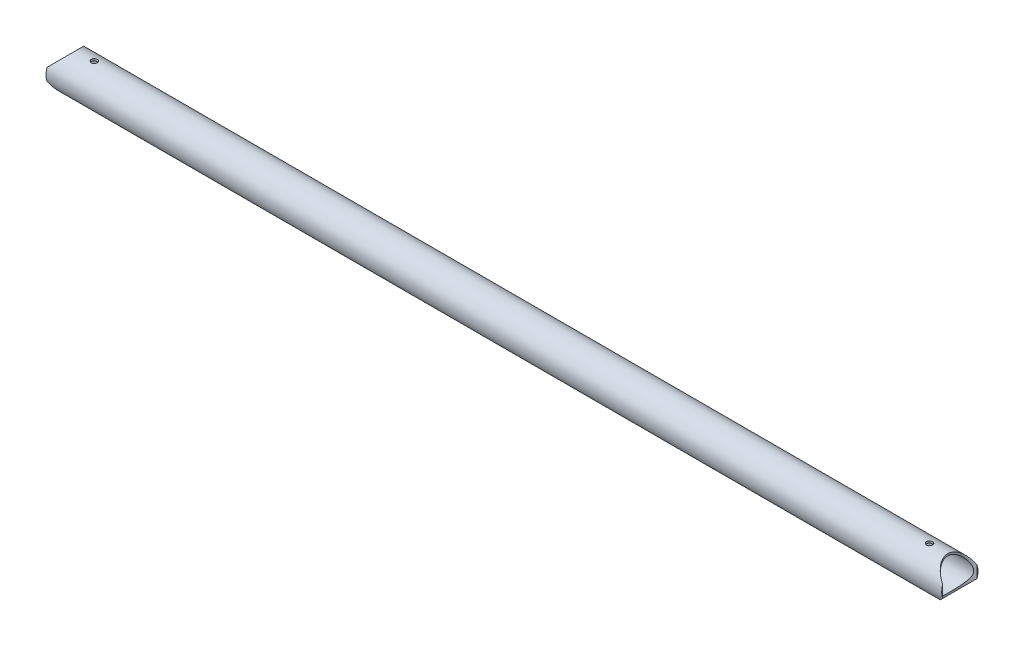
ISO-10303-21;
HEADER;
FILE_DESCRIPTION(('STEP AP214'),'2;1');
FILE_NAME('part.step','',(''),(''),'','','');
FILE_SCHEMA(('AUTOMOTIVE_DESIGN { 1 0 10303 214 1 1 1 1 }'));
ENDSEC;
DATA;
#1=APPLICATION_CONTEXT('core data for automotive mechanical design processes');
#2=APPLICATION_PROTOCOL_DEFINITION('international standard','automotive_design',2000,#1);
#3=PRODUCT_CONTEXT('',#1,'mechanical');
#4=PRODUCT('Part','Part','',(#3));
#5=PRODUCT_RELATED_PRODUCT_CATEGORY('part','',(#4));
#6=PRODUCT_DEFINITION_FORMATION('','',#4);
#7=PRODUCT_DEFINITION_CONTEXT('part definition',#1,'design');
#8=PRODUCT_DEFINITION('design','',#6,#7);
#9=PRODUCT_DEFINITION_SHAPE('','',#8);
#10=(LENGTH_UNIT() NAMED_UNIT(*) SI_UNIT(.MILLI.,.METRE.));
#11=(NAMED_UNIT(*) PLANE_ANGLE_UNIT() SI_UNIT($,.RADIAN.));
#12=(NAMED_UNIT(*) SI_UNIT($,.STERADIAN.) SOLID_ANGLE_UNIT());
#13=UNCERTAINTY_MEASURE_WITH_UNIT(LENGTH_MEASURE(1.E-05),#10,'distance_accuracy_value','');
#14=(GEOMETRIC_REPRESENTATION_CONTEXT(3) GLOBAL_UNCERTAINTY_ASSIGNED_CONTEXT((#13)) GLOBAL_UNIT_ASSIGNED_CONTEXT((#10,
#11,#12)) REPRESENTATION_CONTEXT('',''));
#15=CARTESIAN_POINT('',(0.,0.,0.));
#16=DIRECTION('',(0.,0.,1.));
#17=DIRECTION('',(1.,0.,0.));
#18=AXIS2_PLACEMENT_3D('',#15,#16,#17);
#19=CARTESIAN_POINT('',(469.9,0.,0.));
#20=DIRECTION('',(-1.,0.,0.));
#21=DIRECTION('',(0.,0.,1.));
#22=AXIS2_PLACEMENT_3D('',#19,#20,#21);
#23=CYLINDRICAL_SURFACE('',#22,19.05);
#24=CARTESIAN_POINT('',(-438.15,-18.7835533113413,3.17499999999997));
#25=CARTESIAN_POINT('',(-437.972992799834,-18.7835565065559,3.17499288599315));
#26=CARTESIAN_POINT('',(-437.795888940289,-18.7860824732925,3.16014756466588));
#27=CARTESIAN_POINT('',(-437.446650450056,-18.7959042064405,3.10118433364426));
#28=CARTESIAN_POINT('',(-437.274520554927,-18.8032043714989,3.05703942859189));
#29=CARTESIAN_POINT('',(-436.940334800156,-18.8217252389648,2.94084952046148));
#30=CARTESIAN_POINT('',(-436.778270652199,-18.8329426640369,2.86882783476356));
#31=CARTESIAN_POINT('',(-436.468544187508,-18.858030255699,2.69898685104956));
#32=CARTESIAN_POINT('',(-436.320880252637,-18.8719001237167,2.60117045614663));
#33=CARTESIAN_POINT('',(-436.042672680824,-18.9008825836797,2.38148815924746));
#34=CARTESIAN_POINT('',(-435.912291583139,-18.9160050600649,2.25941769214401));
#35=CARTESIAN_POINT('',(-435.673762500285,-18.945701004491,1.99513444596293));
#36=CARTESIAN_POINT('',(-435.565615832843,-18.960274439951,1.85292047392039));
#37=CARTESIAN_POINT('',(-435.374015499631,-18.9873348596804,1.55133404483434));
#38=CARTESIAN_POINT('',(-435.290713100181,-18.9998088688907,1.39186422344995));
#39=CARTESIAN_POINT('',(-435.152138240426,-19.0211549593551,1.06095243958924));
#40=CARTESIAN_POINT('',(-435.096863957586,-19.0300272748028,0.88951125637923));
#41=CARTESIAN_POINT('',(-435.01641148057,-19.0431005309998,0.541202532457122));
#42=CARTESIAN_POINT('',(-434.990960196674,-19.0473438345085,0.364399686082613));
#43=CARTESIAN_POINT('',(-434.970026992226,-19.0508265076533,0.00898561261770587));
#44=CARTESIAN_POINT('',(-434.974543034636,-19.0500662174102,-0.169625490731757));
#45=CARTESIAN_POINT('',(-435.013203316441,-19.0436609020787,-0.521718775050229));
#46=CARTESIAN_POINT('',(-435.04705365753,-19.0380643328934,-0.695234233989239));
#47=CARTESIAN_POINT('',(-435.142958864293,-19.0226693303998,-1.03408731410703));
#48=CARTESIAN_POINT('',(-435.205014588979,-19.0128707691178,-1.19942468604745));
#49=CARTESIAN_POINT('',(-435.3558611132,-18.9900902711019,-1.51810230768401));
#50=CARTESIAN_POINT('',(-435.444773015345,-18.9770939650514,-1.67138416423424));
#51=CARTESIAN_POINT('',(-435.646719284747,-18.949361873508,-1.96096322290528));
#52=CARTESIAN_POINT('',(-435.759755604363,-18.934625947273,-2.09725904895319));
#53=CARTESIAN_POINT('',(-436.008372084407,-18.904842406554,-2.35073351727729));
#54=CARTESIAN_POINT('',(-436.144209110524,-18.8897931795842,-2.46766016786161));
#55=CARTESIAN_POINT('',(-436.433705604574,-18.861252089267,-2.67710232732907));
#56=CARTESIAN_POINT('',(-436.587365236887,-18.8477602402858,-2.76961761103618));
#57=CARTESIAN_POINT('',(-436.908437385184,-18.8238606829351,-2.92766043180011));
#58=CARTESIAN_POINT('',(-437.075865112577,-18.813456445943,-2.99315762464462));
#59=CARTESIAN_POINT('',(-437.419558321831,-18.7969675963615,-3.09502793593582));
#60=CARTESIAN_POINT('',(-437.595823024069,-18.7908826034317,-3.13140361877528));
#61=CARTESIAN_POINT('',(-437.949932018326,-18.7837947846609,-3.17364349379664));
#62=CARTESIAN_POINT('',(-438.127732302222,-18.7827321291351,-3.17986690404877));
#63=CARTESIAN_POINT('',(-438.481834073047,-18.785649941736,-3.16258283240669));
#64=CARTESIAN_POINT('',(-438.658135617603,-18.7896302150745,-3.13907649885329));
#65=CARTESIAN_POINT('',(-439.003094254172,-18.8021301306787,-3.06330646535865));
#66=CARTESIAN_POINT('',(-439.171792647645,-18.810620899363,-3.01122561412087));
#67=CARTESIAN_POINT('',(-439.498067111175,-18.8311608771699,-2.87997670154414));
#68=CARTESIAN_POINT('',(-439.65564251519,-18.8432102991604,-2.80080701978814));
#69=CARTESIAN_POINT('',(-439.956796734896,-18.8696489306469,-2.61677997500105));
#70=CARTESIAN_POINT('',(-440.1002330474,-18.8840586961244,-2.5116924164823));
#71=CARTESIAN_POINT('',(-440.367564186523,-18.9135342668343,-2.27912862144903));
#72=CARTESIAN_POINT('',(-440.491457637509,-18.9286001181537,-2.15165081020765));
#73=CARTESIAN_POINT('',(-440.717497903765,-18.957879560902,-1.87633364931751));
#74=CARTESIAN_POINT('',(-440.819405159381,-18.9720826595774,-1.72829633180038));
#75=CARTESIAN_POINT('',(-440.996902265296,-18.9978679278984,-1.41699417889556));
#76=CARTESIAN_POINT('',(-441.072492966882,-19.0094501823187,-1.25372983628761));
#77=CARTESIAN_POINT('',(-441.194838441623,-19.0286431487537,-0.917319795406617));
#78=CARTESIAN_POINT('',(-441.241718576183,-19.0362711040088,-0.744220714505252));
#79=CARTESIAN_POINT('',(-441.305715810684,-19.0467689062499,-0.392469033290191));
#80=CARTESIAN_POINT('',(-441.32283535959,-19.0496391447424,-0.213816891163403));
#81=CARTESIAN_POINT('',(-441.326754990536,-19.0502925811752,0.141657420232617));
#82=CARTESIAN_POINT('',(-441.313919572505,-19.0481369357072,0.318475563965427));
#83=CARTESIAN_POINT('',(-441.259082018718,-19.0391056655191,0.667400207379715));
#84=CARTESIAN_POINT('',(-441.217080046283,-19.0322300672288,0.839506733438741));
#85=CARTESIAN_POINT('',(-441.105241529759,-19.014528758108,1.17398348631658));
#86=CARTESIAN_POINT('',(-441.035435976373,-19.0037074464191,1.33636432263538));
#87=CARTESIAN_POINT('',(-440.870012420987,-18.979296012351,1.64716517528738));
#88=CARTESIAN_POINT('',(-440.774393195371,-18.9657057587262,1.79558452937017));
#89=CARTESIAN_POINT('',(-440.558764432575,-18.9370668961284,2.07608544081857));
#90=CARTESIAN_POINT('',(-440.438487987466,-18.9220033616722,2.20796031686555));
#91=CARTESIAN_POINT('',(-440.177519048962,-18.8922190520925,2.44978412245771));
#92=CARTESIAN_POINT('',(-440.036821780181,-18.8774983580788,2.55972790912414));
#93=CARTESIAN_POINT('',(-439.737823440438,-18.8499539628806,2.75528312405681));
#94=CARTESIAN_POINT('',(-439.579404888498,-18.8371444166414,2.84071693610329));
#95=CARTESIAN_POINT('',(-439.250316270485,-18.8150399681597,2.98362946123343));
#96=CARTESIAN_POINT('',(-439.0796586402,-18.805741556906,3.04113610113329));
#97=CARTESIAN_POINT('',(-438.781947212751,-18.7937742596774,3.1140730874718));
#98=CARTESIAN_POINT('',(-438.656695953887,-18.7899627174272,3.13688402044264));
#99=CARTESIAN_POINT('',(-438.404313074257,-18.7848511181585,3.16734989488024));
#100=CARTESIAN_POINT('',(-438.277181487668,-18.7835510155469,3.17500511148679));
#101=CARTESIAN_POINT('',(-438.15,-18.7835533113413,3.17499999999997));
#102=B_SPLINE_CURVE_WITH_KNOTS('',3,(#24,#25,#26,#27,#28,#29,#30,#31,#32,#33,#34,#35,#36,#37,
#38,#39,#40,#41,#42,#43,#44,#45,#46,#47,#48,#49,#50,#51,#52,#53,#54,#55,#56,#57,#58,#59,#60,#61,
#62,#63,#64,#65,#66,#67,#68,#69,#70,#71,#72,#73,#74,#75,#76,#77,#78,#79,#80,#81,#82,#83,#84,#85,
#86,#87,#88,#89,#90,#91,#92,#93,#94,#95,#96,#97,#98,#99,#100,#101),.UNSPECIFIED.,.T.,.F.,(4,2,2,
2,2,2,2,2,2,2,2,2,2,2,2,2,2,2,2,2,2,2,2,2,2,2,2,2,2,2,2,2,2,2,2,2,2,2,4),(0.,0.530556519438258,
1.061602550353,1.59220534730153,2.12274845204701,2.65797232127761,3.19322790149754,
3.73167884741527,4.27009477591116,4.80354090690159,5.3369507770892,5.86507743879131,
6.39322018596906,6.92378097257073,7.45438471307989,7.99142576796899,8.52847177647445,
9.06611931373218,9.60371950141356,10.1348989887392,10.6660579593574,11.1938570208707,
11.7216876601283,12.2543867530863,12.7871233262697,13.3254002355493,13.863659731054,
14.399551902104,14.9353999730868,15.464761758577,15.994120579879,16.5228910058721,
17.0516865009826,17.5865408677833,18.1215205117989,18.6602843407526,19.1985082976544,
19.5797255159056,19.9609358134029),.UNSPECIFIED.);
#103=CARTESIAN_POINT('',(-438.15,-18.7835533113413,3.17499999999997));
#104=VERTEX_POINT('',#103);
#105=EDGE_CURVE('E108',#104,#104,#102,.T.);
#106=ORIENTED_EDGE('',*,*,#105,.T.);
#107=EDGE_LOOP('',(#106));
#108=FACE_BOUND('',#107,.T.);
#109=CARTESIAN_POINT('',(-438.15,18.7835533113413,3.17499999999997));
#110=CARTESIAN_POINT('',(-438.327007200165,18.7835565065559,3.17499288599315));
#111=CARTESIAN_POINT('',(-438.504111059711,18.7860824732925,3.16014756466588));
#112=CARTESIAN_POINT('',(-438.853349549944,18.7959042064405,3.10118433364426));
#113=CARTESIAN_POINT('',(-439.025479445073,18.8032043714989,3.05703942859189));
#114=CARTESIAN_POINT('',(-439.359665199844,18.8217252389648,2.94084952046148));
#115=CARTESIAN_POINT('',(-439.521729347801,18.8329426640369,2.86882783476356));
#116=CARTESIAN_POINT('',(-439.831455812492,18.858030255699,2.69898685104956));
#117=CARTESIAN_POINT('',(-439.979119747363,18.8719001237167,2.60117045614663));
#118=CARTESIAN_POINT('',(-440.257327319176,18.9008825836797,2.38148815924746));
#119=CARTESIAN_POINT('',(-440.387708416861,18.9160050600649,2.25941769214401));
#120=CARTESIAN_POINT('',(-440.626237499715,18.945701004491,1.99513444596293));
#121=CARTESIAN_POINT('',(-440.734384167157,18.960274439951,1.85292047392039));
#122=CARTESIAN_POINT('',(-440.925984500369,18.9873348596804,1.55133404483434));
#123=CARTESIAN_POINT('',(-441.009286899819,18.9998088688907,1.39186422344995));
#124=CARTESIAN_POINT('',(-441.147861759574,19.0211549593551,1.06095243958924));
#125=CARTESIAN_POINT('',(-441.203136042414,19.0300272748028,0.88951125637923));
#126=CARTESIAN_POINT('',(-441.283588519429,19.0431005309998,0.541202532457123));
#127=CARTESIAN_POINT('',(-441.309039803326,19.0473438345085,0.364399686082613));
#128=CARTESIAN_POINT('',(-441.329973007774,19.0508265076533,0.00898561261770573));
#129=CARTESIAN_POINT('',(-441.325456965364,19.0500662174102,-0.169625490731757));
#130=CARTESIAN_POINT('',(-441.286796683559,19.0436609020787,-0.52171877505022));
#131=CARTESIAN_POINT('',(-441.25294634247,19.0380643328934,-0.695234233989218));
#132=CARTESIAN_POINT('',(-441.157041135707,19.0226693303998,-1.03408731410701));
#133=CARTESIAN_POINT('',(-441.094985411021,19.0128707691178,-1.19942468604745));
#134=CARTESIAN_POINT('',(-440.9441388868,18.9900902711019,-1.51810230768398));
#135=CARTESIAN_POINT('',(-440.855226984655,18.9770939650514,-1.67138416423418));
#136=CARTESIAN_POINT('',(-440.653280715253,18.949361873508,-1.96096322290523));
#137=CARTESIAN_POINT('',(-440.540244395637,18.934625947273,-2.09725904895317));
#138=CARTESIAN_POINT('',(-440.291627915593,18.904842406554,-2.35073351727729));
#139=CARTESIAN_POINT('',(-440.155790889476,18.8897931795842,-2.46766016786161));
#140=CARTESIAN_POINT('',(-439.866294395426,18.861252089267,-2.67710232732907));
#141=CARTESIAN_POINT('',(-439.712634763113,18.8477602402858,-2.76961761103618));
#142=CARTESIAN_POINT('',(-439.391562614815,18.8238606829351,-2.92766043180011));
#143=CARTESIAN_POINT('',(-439.224134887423,18.813456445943,-2.99315762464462));
#144=CARTESIAN_POINT('',(-438.880441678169,18.7969675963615,-3.09502793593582));
#145=CARTESIAN_POINT('',(-438.704176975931,18.7908826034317,-3.13140361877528));
#146=CARTESIAN_POINT('',(-438.350067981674,18.7837947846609,-3.17364349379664));
#147=CARTESIAN_POINT('',(-438.172267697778,18.7827321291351,-3.17986690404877));
#148=CARTESIAN_POINT('',(-437.818165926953,18.785649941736,-3.16258283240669));
#149=CARTESIAN_POINT('',(-437.641864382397,18.7896302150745,-3.13907649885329));
#150=CARTESIAN_POINT('',(-437.296905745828,18.8021301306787,-3.06330646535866));
#151=CARTESIAN_POINT('',(-437.128207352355,18.810620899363,-3.0112256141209));
#152=CARTESIAN_POINT('',(-436.801932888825,18.8311608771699,-2.87997670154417));
#153=CARTESIAN_POINT('',(-436.64435748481,18.8432102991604,-2.80080701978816));
#154=CARTESIAN_POINT('',(-436.343203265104,18.8696489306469,-2.61677997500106));
#155=CARTESIAN_POINT('',(-436.1997669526,18.8840586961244,-2.51169241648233));
#156=CARTESIAN_POINT('',(-435.932435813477,18.9135342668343,-2.27912862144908));
#157=CARTESIAN_POINT('',(-435.808542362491,18.9286001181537,-2.15165081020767));
#158=CARTESIAN_POINT('',(-435.582502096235,18.957879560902,-1.87633364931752));
#159=CARTESIAN_POINT('',(-435.480594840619,18.9720826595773,-1.72829633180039));
#160=CARTESIAN_POINT('',(-435.303097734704,18.9978679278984,-1.41699417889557));
#161=CARTESIAN_POINT('',(-435.227507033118,19.0094501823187,-1.25372983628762));
#162=CARTESIAN_POINT('',(-435.105161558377,19.0286431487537,-0.917319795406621));
#163=CARTESIAN_POINT('',(-435.058281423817,19.0362711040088,-0.744220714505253));
#164=CARTESIAN_POINT('',(-434.994284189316,19.0467689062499,-0.392469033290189));
#165=CARTESIAN_POINT('',(-434.97716464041,19.0496391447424,-0.213816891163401));
#166=CARTESIAN_POINT('',(-434.973245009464,19.0502925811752,0.141657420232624));
#167=CARTESIAN_POINT('',(-434.986080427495,19.0481369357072,0.318475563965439));
#168=CARTESIAN_POINT('',(-435.040917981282,19.0391056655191,0.667400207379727));
#169=CARTESIAN_POINT('',(-435.082919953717,19.0322300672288,0.839506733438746));
#170=CARTESIAN_POINT('',(-435.19475847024,19.014528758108,1.17398348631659));
#171=CARTESIAN_POINT('',(-435.264564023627,19.0037074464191,1.3363643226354));
#172=CARTESIAN_POINT('',(-435.429987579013,18.979296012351,1.6471651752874));
#173=CARTESIAN_POINT('',(-435.525606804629,18.9657057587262,1.79558452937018));
#174=CARTESIAN_POINT('',(-435.741235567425,18.9370668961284,2.07608544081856));
#175=CARTESIAN_POINT('',(-435.861512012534,18.9220033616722,2.20796031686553));
#176=CARTESIAN_POINT('',(-436.122480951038,18.8922190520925,2.44978412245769));
#177=CARTESIAN_POINT('',(-436.263178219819,18.8774983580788,2.55972790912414));
#178=CARTESIAN_POINT('',(-436.562176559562,18.8499539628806,2.7552831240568));
#179=CARTESIAN_POINT('',(-436.720595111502,18.8371444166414,2.84071693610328));
#180=CARTESIAN_POINT('',(-437.049683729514,18.8150399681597,2.98362946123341));
#181=CARTESIAN_POINT('',(-437.2203413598,18.805741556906,3.04113610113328));
#182=CARTESIAN_POINT('',(-437.518052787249,18.7937742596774,3.11407308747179));
#183=CARTESIAN_POINT('',(-437.643304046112,18.7899627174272,3.13688402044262));
#184=CARTESIAN_POINT('',(-437.895686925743,18.7848511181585,3.16734989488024));
#185=CARTESIAN_POINT('',(-438.022818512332,18.7835510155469,3.17500511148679));
#186=CARTESIAN_POINT('',(-438.15,18.7835533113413,3.17499999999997));
#187=B_SPLINE_CURVE_WITH_KNOTS('',3,(#109,#110,#111,#112,#113,#114,#115,#116,#117,#118,#119,
#120,#121,#122,#123,#124,#125,#126,#127,#128,#129,#130,#131,#132,#133,#134,#135,#136,#137,#138,
#139,#140,#141,#142,#143,#144,#145,#146,#147,#148,#149,#150,#151,#152,#153,#154,#155,#156,#157,
#158,#159,#160,#161,#162,#163,#164,#165,#166,#167,#168,#169,#170,#171,#172,#173,#174,#175,#176,
#177,#178,#179,#180,#181,#182,#183,#184,#185,#186),.UNSPECIFIED.,.T.,.F.,(4,2,2,2,2,2,2,2,2,2,2,
2,2,2,2,2,2,2,2,2,2,2,2,2,2,2,2,2,2,2,2,2,2,2,2,2,2,2,4),(0.,0.530556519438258,1.061602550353,
1.59220534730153,2.12274845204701,2.65797232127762,3.19322790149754,3.73167884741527,
4.27009477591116,4.80354090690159,5.3369507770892,5.86507743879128,6.39322018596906,
6.92378097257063,7.45438471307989,7.99142576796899,8.52847177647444,9.06611931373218,
9.60371950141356,10.1348989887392,10.6660579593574,11.1938570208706,11.7216876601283,
12.2543867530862,12.7871233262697,13.3254002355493,13.863659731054,14.399551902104,
14.9353999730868,15.4647617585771,15.994120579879,16.5228910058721,17.0516865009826,
17.5865408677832,18.1215205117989,18.6602843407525,19.1985082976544,19.5797255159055,
19.9609358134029),.UNSPECIFIED.);
#188=CARTESIAN_POINT('',(-438.15,18.7835533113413,3.17499999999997));
#189=VERTEX_POINT('',#188);
#190=EDGE_CURVE('E102',#189,#189,#187,.T.);
#191=ORIENTED_EDGE('',*,*,#190,.T.);
#192=EDGE_LOOP('',(#191));
#193=FACE_BOUND('',#192,.T.);
#194=CARTESIAN_POINT('',(-469.9,0.,0.));
#195=DIRECTION('',(1.,0.,0.));
#196=DIRECTION('',(0.,0.,-1.));
#197=AXIS2_PLACEMENT_3D('',#194,#195,#196);
#198=CIRCLE('',#197,19.05);
#199=CARTESIAN_POINT('',(-469.9,-6.3500000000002,-17.9605122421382));
#200=VERTEX_POINT('',#199);
#201=CARTESIAN_POINT('',(-469.9,6.35000000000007,-17.9605122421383));
#202=VERTEX_POINT('',#201);
#203=EDGE_CURVE('E193',#200,#202,#198,.T.);
#204=ORIENTED_EDGE('',*,*,#203,.T.);
#205=CARTESIAN_POINT('',(-476.25,0.,0.));
#206=DIRECTION('',(-0.707106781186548,0.707106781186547,0.));
#207=DIRECTION('',(-0.707106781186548,-0.707106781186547,0.));
#208=AXIS2_PLACEMENT_3D('',#205,#206,#207);
#209=ELLIPSE('',#208,26.9407683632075,19.05);
#210=CARTESIAN_POINT('',(-469.9,6.35000000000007,17.9605122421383));
#211=VERTEX_POINT('',#210);
#212=EDGE_CURVE('E58',#202,#211,#209,.F.);
#213=ORIENTED_EDGE('',*,*,#212,.T.);
#214=CARTESIAN_POINT('',(-469.9,-6.3500000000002,17.9605122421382));
#215=VERTEX_POINT('',#214);
#216=EDGE_CURVE('E195',#211,#215,#198,.T.);
#217=ORIENTED_EDGE('',*,*,#216,.T.);
#218=CARTESIAN_POINT('',(-476.25,0.,0.));
#219=DIRECTION('',(-0.707106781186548,-0.707106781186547,0.));
#220=DIRECTION('',(-0.707106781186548,0.707106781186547,0.));
#221=AXIS2_PLACEMENT_3D('',#218,#219,#220);
#222=ELLIPSE('',#221,26.9407683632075,19.05);
#223=EDGE_CURVE('E51',#215,#200,#222,.F.);
#224=ORIENTED_EDGE('',*,*,#223,.T.);
#225=EDGE_LOOP('',(#204,#213,#217,#224));
#226=FACE_BOUND('',#225,.T.);
#227=CARTESIAN_POINT('',(476.25,0.,0.));
#228=DIRECTION('',(-0.707106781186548,0.707106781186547,0.));
#229=DIRECTION('',(-0.707106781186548,-0.707106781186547,0.));
#230=AXIS2_PLACEMENT_3D('',#227,#228,#229);
#231=ELLIPSE('',#230,26.9407683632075,19.05);
#232=CARTESIAN_POINT('',(469.9,-6.35000000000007,17.9605122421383));
#233=VERTEX_POINT('',#232);
#234=CARTESIAN_POINT('',(469.9,-6.35000000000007,-17.9605122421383));
#235=VERTEX_POINT('',#234);
#236=EDGE_CURVE('E94',#233,#235,#231,.F.);
#237=ORIENTED_EDGE('',*,*,#236,.F.);
#238=CARTESIAN_POINT('',(469.9,0.,0.));
#239=DIRECTION('',(1.,0.,0.));
#240=DIRECTION('',(0.,0.,-1.));
#241=AXIS2_PLACEMENT_3D('',#238,#239,#240);
#242=CIRCLE('',#241,19.05);
#243=CARTESIAN_POINT('',(469.9,6.35000000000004,17.9605122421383));
#244=VERTEX_POINT('',#243);
#245=EDGE_CURVE('E11',#244,#233,#242,.T.);
#246=ORIENTED_EDGE('',*,*,#245,.F.);
#247=CARTESIAN_POINT('',(476.25,0.,0.));
#248=DIRECTION('',(-0.707106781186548,-0.707106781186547,0.));
#249=DIRECTION('',(-0.707106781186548,0.707106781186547,0.));
#250=AXIS2_PLACEMENT_3D('',#247,#248,#249);
#251=ELLIPSE('',#250,26.9407683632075,19.05);
#252=CARTESIAN_POINT('',(469.9,6.35000000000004,-17.9605122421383));
#253=VERTEX_POINT('',#252);
#254=EDGE_CURVE('E77',#253,#244,#251,.F.);
#255=ORIENTED_EDGE('',*,*,#254,.F.);
#256=EDGE_CURVE('E43',#235,#253,#242,.T.);
#257=ORIENTED_EDGE('',*,*,#256,.F.);
#258=EDGE_LOOP('',(#237,#246,#255,#257));
#259=FACE_BOUND('',#258,.T.);
#260=CARTESIAN_POINT('',(438.15,18.7835533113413,3.17499999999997));
#261=CARTESIAN_POINT('',(438.327007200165,18.7835565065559,3.17499288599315));
#262=CARTESIAN_POINT('',(438.504111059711,18.7860824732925,3.16014756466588));
#263=CARTESIAN_POINT('',(438.853349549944,18.7959042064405,3.10118433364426));
#264=CARTESIAN_POINT('',(439.025479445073,18.8032043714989,3.05703942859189));
#265=CARTESIAN_POINT('',(439.359665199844,18.8217252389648,2.94084952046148));
#266=CARTESIAN_POINT('',(439.521729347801,18.8329426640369,2.86882783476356));
#267=CARTESIAN_POINT('',(439.831455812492,18.858030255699,2.69898685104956));
#268=CARTESIAN_POINT('',(439.979119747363,18.8719001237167,2.60117045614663));
#269=CARTESIAN_POINT('',(440.257327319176,18.9008825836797,2.38148815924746));
#270=CARTESIAN_POINT('',(440.387708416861,18.9160050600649,2.25941769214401));
#271=CARTESIAN_POINT('',(440.626237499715,18.945701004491,1.99513444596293));
#272=CARTESIAN_POINT('',(440.734384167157,18.960274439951,1.85292047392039));
#273=CARTESIAN_POINT('',(440.925984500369,18.9873348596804,1.55133404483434));
#274=CARTESIAN_POINT('',(441.009286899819,18.9998088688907,1.39186422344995));
#275=CARTESIAN_POINT('',(441.147861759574,19.0211549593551,1.06095243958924));
#276=CARTESIAN_POINT('',(441.203136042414,19.0300272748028,0.88951125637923));
#277=CARTESIAN_POINT('',(441.283588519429,19.0431005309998,0.541202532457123));
#278=CARTESIAN_POINT('',(441.309039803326,19.0473438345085,0.364399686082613));
#279=CARTESIAN_POINT('',(441.329973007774,19.0508265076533,0.00898561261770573));
#280=CARTESIAN_POINT('',(441.325456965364,19.0500662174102,-0.169625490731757));
#281=CARTESIAN_POINT('',(441.286796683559,19.0436609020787,-0.52171877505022));
#282=CARTESIAN_POINT('',(441.25294634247,19.0380643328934,-0.695234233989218));
#283=CARTESIAN_POINT('',(441.157041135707,19.0226693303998,-1.03408731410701));
#284=CARTESIAN_POINT('',(441.094985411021,19.0128707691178,-1.19942468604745));
#285=CARTESIAN_POINT('',(440.9441388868,18.9900902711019,-1.51810230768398));
#286=CARTESIAN_POINT('',(440.855226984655,18.9770939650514,-1.67138416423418));
#287=CARTESIAN_POINT('',(440.653280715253,18.949361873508,-1.96096322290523));
#288=CARTESIAN_POINT('',(440.540244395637,18.934625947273,-2.09725904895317));
#289=CARTESIAN_POINT('',(440.291627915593,18.904842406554,-2.35073351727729));
#290=CARTESIAN_POINT('',(440.155790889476,18.8897931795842,-2.46766016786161));
#291=CARTESIAN_POINT('',(439.866294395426,18.861252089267,-2.67710232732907));
#292=CARTESIAN_POINT('',(439.712634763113,18.8477602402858,-2.76961761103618));
#293=CARTESIAN_POINT('',(439.391562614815,18.8238606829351,-2.92766043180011));
#294=CARTESIAN_POINT('',(439.224134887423,18.813456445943,-2.99315762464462));
#295=CARTESIAN_POINT('',(438.880441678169,18.7969675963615,-3.09502793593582));
#296=CARTESIAN_POINT('',(438.704176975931,18.7908826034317,-3.13140361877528));
#297=CARTESIAN_POINT('',(438.350067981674,18.7837947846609,-3.17364349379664));
#298=CARTESIAN_POINT('',(438.172267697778,18.7827321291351,-3.17986690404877));
#299=CARTESIAN_POINT('',(437.818165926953,18.785649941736,-3.16258283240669));
#300=CARTESIAN_POINT('',(437.641864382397,18.7896302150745,-3.13907649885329));
#301=CARTESIAN_POINT('',(437.296905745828,18.8021301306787,-3.06330646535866));
#302=CARTESIAN_POINT('',(437.128207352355,18.810620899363,-3.0112256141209));
#303=CARTESIAN_POINT('',(436.801932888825,18.8311608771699,-2.87997670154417));
#304=CARTESIAN_POINT('',(436.64435748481,18.8432102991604,-2.80080701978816));
#305=CARTESIAN_POINT('',(436.343203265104,18.8696489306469,-2.61677997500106));
#306=CARTESIAN_POINT('',(436.1997669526,18.8840586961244,-2.51169241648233));
#307=CARTESIAN_POINT('',(435.932435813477,18.9135342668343,-2.27912862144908));
#308=CARTESIAN_POINT('',(435.808542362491,18.9286001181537,-2.15165081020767));
#309=CARTESIAN_POINT('',(435.582502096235,18.957879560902,-1.87633364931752));
#310=CARTESIAN_POINT('',(435.480594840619,18.9720826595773,-1.72829633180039));
#311=CARTESIAN_POINT('',(435.303097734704,18.9978679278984,-1.41699417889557));
#312=CARTESIAN_POINT('',(435.227507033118,19.0094501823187,-1.25372983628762));
#313=CARTESIAN_POINT('',(435.105161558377,19.0286431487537,-0.917319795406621));
#314=CARTESIAN_POINT('',(435.058281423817,19.0362711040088,-0.744220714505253));
#315=CARTESIAN_POINT('',(434.994284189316,19.0467689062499,-0.392469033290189));
#316=CARTESIAN_POINT('',(434.97716464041,19.0496391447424,-0.213816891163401));
#317=CARTESIAN_POINT('',(434.973245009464,19.0502925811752,0.141657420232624));
#318=CARTESIAN_POINT('',(434.986080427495,19.0481369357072,0.318475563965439));
#319=CARTESIAN_POINT('',(435.040917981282,19.0391056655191,0.667400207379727));
#320=CARTESIAN_POINT('',(435.082919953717,19.0322300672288,0.839506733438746));
#321=CARTESIAN_POINT('',(435.19475847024,19.014528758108,1.17398348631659));
#322=CARTESIAN_POINT('',(435.264564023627,19.0037074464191,1.3363643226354));
#323=CARTESIAN_POINT('',(435.429987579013,18.979296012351,1.6471651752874));
#324=CARTESIAN_POINT('',(435.525606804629,18.9657057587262,1.79558452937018));
#325=CARTESIAN_POINT('',(435.741235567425,18.9370668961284,2.07608544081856));
#326=CARTESIAN_POINT('',(435.861512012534,18.9220033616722,2.20796031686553));
#327=CARTESIAN_POINT('',(436.122480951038,18.8922190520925,2.44978412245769));
#328=CARTESIAN_POINT('',(436.263178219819,18.8774983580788,2.55972790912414));
#329=CARTESIAN_POINT('',(436.562176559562,18.8499539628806,2.7552831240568));
#330=CARTESIAN_POINT('',(436.720595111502,18.8371444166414,2.84071693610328));
#331=CARTESIAN_POINT('',(437.049683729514,18.8150399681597,2.98362946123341));
#332=CARTESIAN_POINT('',(437.2203413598,18.805741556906,3.04113610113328));
#333=CARTESIAN_POINT('',(437.518052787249,18.7937742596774,3.11407308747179));
#334=CARTESIAN_POINT('',(437.643304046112,18.7899627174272,3.13688402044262));
#335=CARTESIAN_POINT('',(437.895686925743,18.7848511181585,3.16734989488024));
#336=CARTESIAN_POINT('',(438.022818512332,18.7835510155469,3.17500511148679));
#337=CARTESIAN_POINT('',(438.15,18.7835533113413,3.17499999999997));
#338=B_SPLINE_CURVE_WITH_KNOTS('',3,(#260,#261,#262,#263,#264,#265,#266,#267,#268,#269,#270,
#271,#272,#273,#274,#275,#276,#277,#278,#279,#280,#281,#282,#283,#284,#285,#286,#287,#288,#289,
#290,#291,#292,#293,#294,#295,#296,#297,#298,#299,#300,#301,#302,#303,#304,#305,#306,#307,#308,
#309,#310,#311,#312,#313,#314,#315,#316,#317,#318,#319,#320,#321,#322,#323,#324,#325,#326,#327,
#328,#329,#330,#331,#332,#333,#334,#335,#336,#337),.UNSPECIFIED.,.T.,.F.,(4,2,2,2,2,2,2,2,2,2,2,
2,2,2,2,2,2,2,2,2,2,2,2,2,2,2,2,2,2,2,2,2,2,2,2,2,2,2,4),(0.,0.530556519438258,1.061602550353,
1.59220534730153,2.12274845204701,2.65797232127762,3.19322790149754,3.73167884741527,
4.27009477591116,4.80354090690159,5.3369507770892,5.86507743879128,6.39322018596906,
6.92378097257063,7.45438471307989,7.99142576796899,8.52847177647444,9.06611931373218,
9.60371950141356,10.1348989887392,10.6660579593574,11.1938570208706,11.7216876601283,
12.2543867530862,12.7871233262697,13.3254002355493,13.863659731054,14.399551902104,
14.9353999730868,15.4647617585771,15.994120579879,16.5228910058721,17.0516865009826,
17.5865408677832,18.1215205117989,18.6602843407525,19.1985082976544,19.5797255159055,
19.9609358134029),.UNSPECIFIED.);
#339=CARTESIAN_POINT('',(438.15,18.7835533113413,3.17499999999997));
#340=VERTEX_POINT('',#339);
#341=EDGE_CURVE('E164',#340,#340,#338,.T.);
#342=ORIENTED_EDGE('',*,*,#341,.F.);
#343=EDGE_LOOP('',(#342));
#344=FACE_BOUND('',#343,.T.);
#345=CARTESIAN_POINT('',(438.15,-18.7835533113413,3.17499999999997));
#346=CARTESIAN_POINT('',(437.972992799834,-18.7835565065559,3.17499288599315));
#347=CARTESIAN_POINT('',(437.795888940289,-18.7860824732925,3.16014756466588));
#348=CARTESIAN_POINT('',(437.446650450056,-18.7959042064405,3.10118433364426));
#349=CARTESIAN_POINT('',(437.274520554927,-18.8032043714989,3.05703942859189));
#350=CARTESIAN_POINT('',(436.940334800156,-18.8217252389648,2.94084952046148));
#351=CARTESIAN_POINT('',(436.778270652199,-18.8329426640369,2.86882783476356));
#352=CARTESIAN_POINT('',(436.468544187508,-18.858030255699,2.69898685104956));
#353=CARTESIAN_POINT('',(436.320880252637,-18.8719001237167,2.60117045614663));
#354=CARTESIAN_POINT('',(436.042672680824,-18.9008825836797,2.38148815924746));
#355=CARTESIAN_POINT('',(435.912291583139,-18.9160050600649,2.25941769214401));
#356=CARTESIAN_POINT('',(435.673762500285,-18.945701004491,1.99513444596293));
#357=CARTESIAN_POINT('',(435.565615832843,-18.960274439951,1.85292047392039));
#358=CARTESIAN_POINT('',(435.374015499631,-18.9873348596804,1.55133404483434));
#359=CARTESIAN_POINT('',(435.290713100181,-18.9998088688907,1.39186422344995));
#360=CARTESIAN_POINT('',(435.152138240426,-19.0211549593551,1.06095243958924));
#361=CARTESIAN_POINT('',(435.096863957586,-19.0300272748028,0.88951125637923));
#362=CARTESIAN_POINT('',(435.01641148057,-19.0431005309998,0.541202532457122));
#363=CARTESIAN_POINT('',(434.990960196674,-19.0473438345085,0.364399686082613));
#364=CARTESIAN_POINT('',(434.970026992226,-19.0508265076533,0.00898561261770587));
#365=CARTESIAN_POINT('',(434.974543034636,-19.0500662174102,-0.169625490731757));
#366=CARTESIAN_POINT('',(435.013203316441,-19.0436609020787,-0.521718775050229));
#367=CARTESIAN_POINT('',(435.04705365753,-19.0380643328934,-0.695234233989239));
#368=CARTESIAN_POINT('',(435.142958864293,-19.0226693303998,-1.03408731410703));
#369=CARTESIAN_POINT('',(435.205014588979,-19.0128707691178,-1.19942468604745));
#370=CARTESIAN_POINT('',(435.3558611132,-18.9900902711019,-1.51810230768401));
#371=CARTESIAN_POINT('',(435.444773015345,-18.9770939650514,-1.67138416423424));
#372=CARTESIAN_POINT('',(435.646719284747,-18.949361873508,-1.96096322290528));
#373=CARTESIAN_POINT('',(435.759755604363,-18.934625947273,-2.09725904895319));
#374=CARTESIAN_POINT('',(436.008372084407,-18.904842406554,-2.35073351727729));
#375=CARTESIAN_POINT('',(436.144209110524,-18.8897931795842,-2.46766016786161));
#376=CARTESIAN_POINT('',(436.433705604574,-18.861252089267,-2.67710232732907));
#377=CARTESIAN_POINT('',(436.587365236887,-18.8477602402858,-2.76961761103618));
#378=CARTESIAN_POINT('',(436.908437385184,-18.8238606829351,-2.92766043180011));
#379=CARTESIAN_POINT('',(437.075865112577,-18.813456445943,-2.99315762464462));
#380=CARTESIAN_POINT('',(437.419558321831,-18.7969675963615,-3.09502793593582));
#381=CARTESIAN_POINT('',(437.595823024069,-18.7908826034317,-3.13140361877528));
#382=CARTESIAN_POINT('',(437.949932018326,-18.7837947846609,-3.17364349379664));
#383=CARTESIAN_POINT('',(438.127732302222,-18.7827321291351,-3.17986690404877));
#384=CARTESIAN_POINT('',(438.481834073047,-18.785649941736,-3.16258283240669));
#385=CARTESIAN_POINT('',(438.658135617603,-18.7896302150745,-3.13907649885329));
#386=CARTESIAN_POINT('',(439.003094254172,-18.8021301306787,-3.06330646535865));
#387=CARTESIAN_POINT('',(439.171792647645,-18.810620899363,-3.01122561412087));
#388=CARTESIAN_POINT('',(439.498067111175,-18.8311608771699,-2.87997670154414));
#389=CARTESIAN_POINT('',(439.65564251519,-18.8432102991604,-2.80080701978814));
#390=CARTESIAN_POINT('',(439.956796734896,-18.8696489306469,-2.61677997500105));
#391=CARTESIAN_POINT('',(440.1002330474,-18.8840586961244,-2.5116924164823));
#392=CARTESIAN_POINT('',(440.367564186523,-18.9135342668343,-2.27912862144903));
#393=CARTESIAN_POINT('',(440.491457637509,-18.9286001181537,-2.15165081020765));
#394=CARTESIAN_POINT('',(440.717497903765,-18.957879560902,-1.87633364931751));
#395=CARTESIAN_POINT('',(440.819405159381,-18.9720826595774,-1.72829633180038));
#396=CARTESIAN_POINT('',(440.996902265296,-18.9978679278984,-1.41699417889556));
#397=CARTESIAN_POINT('',(441.072492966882,-19.0094501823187,-1.25372983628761));
#398=CARTESIAN_POINT('',(441.194838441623,-19.0286431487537,-0.917319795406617));
#399=CARTESIAN_POINT('',(441.241718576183,-19.0362711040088,-0.744220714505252));
#400=CARTESIAN_POINT('',(441.305715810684,-19.0467689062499,-0.392469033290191));
#401=CARTESIAN_POINT('',(441.32283535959,-19.0496391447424,-0.213816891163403));
#402=CARTESIAN_POINT('',(441.326754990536,-19.0502925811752,0.141657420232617));
#403=CARTESIAN_POINT('',(441.313919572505,-19.0481369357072,0.318475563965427));
#404=CARTESIAN_POINT('',(441.259082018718,-19.0391056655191,0.667400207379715));
#405=CARTESIAN_POINT('',(441.217080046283,-19.0322300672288,0.839506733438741));
#406=CARTESIAN_POINT('',(441.105241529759,-19.014528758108,1.17398348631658));
#407=CARTESIAN_POINT('',(441.035435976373,-19.0037074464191,1.33636432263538));
#408=CARTESIAN_POINT('',(440.870012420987,-18.979296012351,1.64716517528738));
#409=CARTESIAN_POINT('',(440.774393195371,-18.9657057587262,1.79558452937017));
#410=CARTESIAN_POINT('',(440.558764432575,-18.9370668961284,2.07608544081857));
#411=CARTESIAN_POINT('',(440.438487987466,-18.9220033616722,2.20796031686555));
#412=CARTESIAN_POINT('',(440.177519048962,-18.8922190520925,2.44978412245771));
#413=CARTESIAN_POINT('',(440.036821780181,-18.8774983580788,2.55972790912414));
#414=CARTESIAN_POINT('',(439.737823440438,-18.8499539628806,2.75528312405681));
#415=CARTESIAN_POINT('',(439.579404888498,-18.8371444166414,2.84071693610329));
#416=CARTESIAN_POINT('',(439.250316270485,-18.8150399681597,2.98362946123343));
#417=CARTESIAN_POINT('',(439.0796586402,-18.805741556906,3.04113610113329));
#418=CARTESIAN_POINT('',(438.781947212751,-18.7937742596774,3.1140730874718));
#419=CARTESIAN_POINT('',(438.656695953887,-18.7899627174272,3.13688402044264));
#420=CARTESIAN_POINT('',(438.404313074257,-18.7848511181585,3.16734989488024));
#421=CARTESIAN_POINT('',(438.277181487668,-18.7835510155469,3.17500511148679));
#422=CARTESIAN_POINT('',(438.15,-18.7835533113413,3.17499999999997));
#423=B_SPLINE_CURVE_WITH_KNOTS('',3,(#345,#346,#347,#348,#349,#350,#351,#352,#353,#354,#355,
#356,#357,#358,#359,#360,#361,#362,#363,#364,#365,#366,#367,#368,#369,#370,#371,#372,#373,#374,
#375,#376,#377,#378,#379,#380,#381,#382,#383,#384,#385,#386,#387,#388,#389,#390,#391,#392,#393,
#394,#395,#396,#397,#398,#399,#400,#401,#402,#403,#404,#405,#406,#407,#408,#409,#410,#411,#412,
#413,#414,#415,#416,#417,#418,#419,#420,#421,#422),.UNSPECIFIED.,.T.,.F.,(4,2,2,2,2,2,2,2,2,2,2,
2,2,2,2,2,2,2,2,2,2,2,2,2,2,2,2,2,2,2,2,2,2,2,2,2,2,2,4),(0.,0.530556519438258,1.061602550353,
1.59220534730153,2.12274845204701,2.65797232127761,3.19322790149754,3.73167884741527,
4.27009477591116,4.80354090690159,5.3369507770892,5.86507743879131,6.39322018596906,
6.92378097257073,7.45438471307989,7.99142576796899,8.52847177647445,9.06611931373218,
9.60371950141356,10.1348989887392,10.6660579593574,11.1938570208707,11.7216876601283,
12.2543867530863,12.7871233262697,13.3254002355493,13.863659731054,14.399551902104,
14.9353999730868,15.464761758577,15.994120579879,16.5228910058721,17.0516865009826,
17.5865408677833,18.1215205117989,18.6602843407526,19.1985082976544,19.5797255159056,
19.9609358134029),.UNSPECIFIED.);
#424=CARTESIAN_POINT('',(438.15,-18.7835533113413,3.17499999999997));
#425=VERTEX_POINT('',#424);
#426=EDGE_CURVE('E168',#425,#425,#423,.T.);
#427=ORIENTED_EDGE('',*,*,#426,.F.);
#428=EDGE_LOOP('',(#427));
#429=FACE_BOUND('',#428,.T.);
#430=ADVANCED_FACE('F30',(#108,#193,#226,#259,#344,#429),#23,.T.);
#431=CARTESIAN_POINT('',(469.9,0.,0.));
#432=DIRECTION('',(-1.,0.,0.));
#433=DIRECTION('',(0.,0.,1.));
#434=AXIS2_PLACEMENT_3D('',#431,#432,#433);
#435=CYLINDRICAL_SURFACE('',#434,16.9418);
#436=CARTESIAN_POINT('',(438.15,16.641633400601,3.17499999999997));
#437=CARTESIAN_POINT('',(438.326652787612,16.6416368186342,3.17499322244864));
#438=CARTESIAN_POINT('',(438.503393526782,16.6444767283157,3.16020689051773));
#439=CARTESIAN_POINT('',(438.851891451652,16.6555153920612,3.10149205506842));
#440=CARTESIAN_POINT('',(439.023644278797,16.6637186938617,3.05753881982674));
#441=CARTESIAN_POINT('',(439.357073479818,16.6845231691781,2.94188729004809));
#442=CARTESIAN_POINT('',(439.518759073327,16.6971202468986,2.87021482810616));
#443=CARTESIAN_POINT('',(439.827800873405,16.725288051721,2.70122775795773));
#444=CARTESIAN_POINT('',(439.975158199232,16.7408585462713,2.60391515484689));
#445=CARTESIAN_POINT('',(440.253203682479,16.7734350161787,2.38512049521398));
#446=CARTESIAN_POINT('',(440.383687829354,16.7904550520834,2.26338123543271));
#447=CARTESIAN_POINT('',(440.62250552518,16.8238886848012,1.99974486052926));
#448=CARTESIAN_POINT('',(440.73083762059,16.8403022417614,1.85784642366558));
#449=CARTESIAN_POINT('',(440.923057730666,16.8708241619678,1.55657978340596));
#450=CARTESIAN_POINT('',(441.006753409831,16.8849140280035,1.39708682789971));
#451=CARTESIAN_POINT('',(441.146085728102,16.9090436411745,1.0659953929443));
#452=CARTESIAN_POINT('',(441.201724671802,16.9190837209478,0.894397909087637));
#453=CARTESIAN_POINT('',(441.282733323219,16.9338832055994,0.546082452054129));
#454=CARTESIAN_POINT('',(441.30844693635,16.9387025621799,0.369447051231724));
#455=CARTESIAN_POINT('',(441.329946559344,16.9427242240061,0.0143079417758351));
#456=CARTESIAN_POINT('',(441.325735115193,16.9419270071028,-0.164195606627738));
#457=CARTESIAN_POINT('',(441.287767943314,16.9348522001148,-0.515645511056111));
#458=CARTESIAN_POINT('',(441.254382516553,16.9286433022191,-0.688633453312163));
#459=CARTESIAN_POINT('',(441.159600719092,16.9115198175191,-1.02650764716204));
#460=CARTESIAN_POINT('',(441.098203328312,16.9006050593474,-1.19139360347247));
#461=CARTESIAN_POINT('',(440.948787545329,16.875181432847,-1.5094575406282));
#462=CARTESIAN_POINT('',(440.860621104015,16.8606526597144,-1.66256431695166));
#463=CARTESIAN_POINT('',(440.660279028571,16.8296077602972,-1.95194834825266));
#464=CARTESIAN_POINT('',(440.548100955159,16.8130914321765,-2.08822389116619));
#465=CARTESIAN_POINT('',(440.300879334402,16.7796022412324,-2.34227105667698));
#466=CARTESIAN_POINT('',(440.165511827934,16.76262626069,-2.45972722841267));
#467=CARTESIAN_POINT('',(439.876833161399,16.7303729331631,-2.67031701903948));
#468=CARTESIAN_POINT('',(439.723521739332,16.7150956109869,-2.76345028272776));
#469=CARTESIAN_POINT('',(439.402889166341,16.687964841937,-2.92284037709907));
#470=CARTESIAN_POINT('',(439.23554471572,16.6761172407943,-2.98905139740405));
#471=CARTESIAN_POINT('',(438.89183471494,16.657276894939,-3.0923287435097));
#472=CARTESIAN_POINT('',(438.715470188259,16.6502836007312,-3.12939836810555));
#473=CARTESIAN_POINT('',(438.361570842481,16.6420523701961,-3.17288014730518));
#474=CARTESIAN_POINT('',(438.18409362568,16.6407293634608,-3.17974549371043));
#475=CARTESIAN_POINT('',(437.830528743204,16.6437608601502,-3.16383863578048));
#476=CARTESIAN_POINT('',(437.654441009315,16.6481150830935,-3.14106789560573));
#477=CARTESIAN_POINT('',(437.310143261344,16.6619311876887,-3.06692428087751));
#478=CARTESIAN_POINT('',(437.141880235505,16.6713506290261,-3.01578895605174));
#479=CARTESIAN_POINT('',(436.816310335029,16.6941992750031,-2.88661975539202));
#480=CARTESIAN_POINT('',(436.659004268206,16.7076287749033,-2.80858389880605));
#481=CARTESIAN_POINT('',(436.357817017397,16.7371781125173,-2.62678560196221));
#482=CARTESIAN_POINT('',(436.214111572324,16.7533271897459,-2.52273685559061));
#483=CARTESIAN_POINT('',(435.946036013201,16.7864138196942,-2.29225244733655));
#484=CARTESIAN_POINT('',(435.821667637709,16.8033514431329,-2.16581477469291));
#485=CARTESIAN_POINT('',(435.594103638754,16.8363800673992,-1.89211760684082));
#486=CARTESIAN_POINT('',(435.491212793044,16.8524567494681,-1.74460270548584));
#487=CARTESIAN_POINT('',(435.311675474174,16.8817111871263,-1.43411757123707));
#488=CARTESIAN_POINT('',(435.23502799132,16.8948890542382,-1.2711479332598));
#489=CARTESIAN_POINT('',(435.11060946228,16.9167994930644,-0.935221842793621));
#490=CARTESIAN_POINT('',(435.062688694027,16.9255550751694,-0.7623224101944));
#491=CARTESIAN_POINT('',(434.996606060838,16.9377325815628,-0.410749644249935));
#492=CARTESIAN_POINT('',(434.978441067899,16.9411550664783,-0.232076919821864));
#493=CARTESIAN_POINT('',(434.972494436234,16.9422696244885,0.123047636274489));
#494=CARTESIAN_POINT('',(434.984252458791,16.9400485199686,0.299491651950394));
#495=CARTESIAN_POINT('',(435.036809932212,16.9303058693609,0.647842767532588));
#496=CARTESIAN_POINT('',(435.077609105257,16.9227843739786,0.819749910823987));
#497=CARTESIAN_POINT('',(435.186896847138,16.9032860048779,1.15390448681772));
#498=CARTESIAN_POINT('',(435.255336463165,16.8913170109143,1.3161684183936));
#499=CARTESIAN_POINT('',(435.417907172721,16.8642193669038,1.6269783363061));
#500=CARTESIAN_POINT('',(435.512039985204,16.8490905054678,1.77552340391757));
#501=CARTESIAN_POINT('',(435.724909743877,16.8170694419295,2.05697294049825));
#502=CARTESIAN_POINT('',(435.843979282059,16.8001551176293,2.18962337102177));
#503=CARTESIAN_POINT('',(436.102652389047,16.7666091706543,2.43322036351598));
#504=CARTESIAN_POINT('',(436.242260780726,16.7499776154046,2.54416181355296));
#505=CARTESIAN_POINT('',(436.539592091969,16.7187123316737,2.74215482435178));
#506=CARTESIAN_POINT('',(436.697470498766,16.7040984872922,2.82897612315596));
#507=CARTESIAN_POINT('',(437.025795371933,16.678762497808,2.97472453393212));
#508=CARTESIAN_POINT('',(437.196229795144,16.6680366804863,3.03367798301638));
#509=CARTESIAN_POINT('',(437.49763996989,16.6539282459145,3.11003219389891));
#510=CARTESIAN_POINT('',(437.626850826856,16.6493450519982,3.13435337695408));
#511=CARTESIAN_POINT('',(437.887358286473,16.6431963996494,3.16683958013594));
#512=CARTESIAN_POINT('',(438.018654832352,16.6416308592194,3.17500503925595));
#513=CARTESIAN_POINT('',(438.15,16.641633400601,3.17499999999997));
#514=B_SPLINE_CURVE_WITH_KNOTS('',3,(#436,#437,#438,#439,#440,#441,#442,#443,#444,#445,#446,
#447,#448,#449,#450,#451,#452,#453,#454,#455,#456,#457,#458,#459,#460,#461,#462,#463,#464,#465,
#466,#467,#468,#469,#470,#471,#472,#473,#474,#475,#476,#477,#478,#479,#480,#481,#482,#483,#484,
#485,#486,#487,#488,#489,#490,#491,#492,#493,#494,#495,#496,#497,#498,#499,#500,#501,#502,#503,
#504,#505,#506,#507,#508,#509,#510,#511,#512,#513),.UNSPECIFIED.,.T.,.F.,(4,2,2,2,2,2,2,2,2,2,2,
2,2,2,2,2,2,2,2,2,2,2,2,2,2,2,2,2,2,2,2,2,2,2,2,2,2,2,4),(0.,0.52947770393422,1.05940494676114,
1.58883951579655,2.11823269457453,2.65352408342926,3.18885058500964,3.72825178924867,
4.26760867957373,4.80070402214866,5.33375401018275,5.86013477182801,6.38653470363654,
6.91590068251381,7.44532046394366,7.98285064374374,8.52038867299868,9.05883757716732,
9.59722552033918,10.1275072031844,10.657762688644,11.1836429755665,11.7095619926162,
12.2415460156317,12.7735778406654,13.3127113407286,13.8518240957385,14.3881020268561,
14.9243235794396,15.4523458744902,15.9803631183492,16.5074492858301,17.0345707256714,
17.5692300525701,18.1040151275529,18.6437425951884,19.1829589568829,19.5766477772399,
19.9703258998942),.UNSPECIFIED.);
#515=CARTESIAN_POINT('',(438.15,16.641633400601,3.17499999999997));
#516=VERTEX_POINT('',#515);
#517=EDGE_CURVE('E150',#516,#516,#514,.T.);
#518=ORIENTED_EDGE('',*,*,#517,.T.);
#519=EDGE_LOOP('',(#518));
#520=FACE_BOUND('',#519,.T.);
#521=CARTESIAN_POINT('',(-467.539207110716,0.,16.9418));
#522=CARTESIAN_POINT('',(-467.539202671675,-0.262189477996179,16.9417986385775));
#523=CARTESIAN_POINT('',(-467.527301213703,-0.524399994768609,16.9356945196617));
#524=CARTESIAN_POINT('',(-467.480461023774,-1.04618299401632,16.9114858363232));
#525=CARTESIAN_POINT('',(-467.445518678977,-1.30575505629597,16.8933793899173));
#526=CARTESIAN_POINT('',(-467.354565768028,-1.82080221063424,16.8456631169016));
#527=CARTESIAN_POINT('',(-467.298496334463,-2.07626375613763,16.8160211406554));
#528=CARTESIAN_POINT('',(-467.168144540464,-2.58103055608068,16.7459805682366));
#529=CARTESIAN_POINT('',(-467.093853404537,-2.83033278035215,16.7055767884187));
#530=CARTESIAN_POINT('',(-466.892118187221,-3.43618483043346,16.5937113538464));
#531=CARTESIAN_POINT('',(-466.756009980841,-3.78879033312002,16.5165393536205));
#532=CARTESIAN_POINT('',(-466.460126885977,-4.47896186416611,16.3428979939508));
#533=CARTESIAN_POINT('',(-466.300337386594,-4.81651843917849,16.2464167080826));
#534=CARTESIAN_POINT('',(-465.96361473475,-5.47843096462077,16.0353485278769));
#535=CARTESIAN_POINT('',(-465.786629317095,-5.80274212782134,15.9207057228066));
#536=CARTESIAN_POINT('',(-465.421319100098,-6.43816509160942,15.6745239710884));
#537=CARTESIAN_POINT('',(-465.232995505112,-6.74927828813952,15.5429868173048));
#538=CARTESIAN_POINT('',(-464.882080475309,-7.30685445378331,15.2876283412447));
#539=CARTESIAN_POINT('',(-464.720639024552,-7.5552283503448,15.1663756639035));
#540=CARTESIAN_POINT('',(-464.394516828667,-8.04410768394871,14.9128374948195));
#541=CARTESIAN_POINT('',(-464.229835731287,-8.28461225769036,14.7805507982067));
#542=CARTESIAN_POINT('',(-463.73309265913,-8.9950138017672,14.3671467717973));
#543=CARTESIAN_POINT('',(-463.398427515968,-9.45364852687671,14.0695545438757));
#544=CARTESIAN_POINT('',(-462.732339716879,-10.3409160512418,13.4308738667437));
#545=CARTESIAN_POINT('',(-462.400913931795,-10.7695809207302,13.0898330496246));
#546=CARTESIAN_POINT('',(-461.74876624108,-11.5962184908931,12.3634450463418));
#547=CARTESIAN_POINT('',(-461.428039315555,-11.9942057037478,11.9781190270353));
#548=CARTESIAN_POINT('',(-460.87853893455,-12.6661649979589,11.2593954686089));
#549=CARTESIAN_POINT('',(-460.646013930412,-12.9471455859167,10.9353918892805));
#550=CARTESIAN_POINT('',(-460.194564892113,-13.487817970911,10.2610948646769));
#551=CARTESIAN_POINT('',(-459.975640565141,-13.7475102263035,9.91080198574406));
#552=CARTESIAN_POINT('',(-459.555078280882,-14.2428782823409,9.18465560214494));
#553=CARTESIAN_POINT('',(-459.353416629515,-14.478587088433,8.80883844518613));
#554=CARTESIAN_POINT('',(-458.970592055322,-14.9235681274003,8.03193403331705));
#555=CARTESIAN_POINT('',(-458.78942484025,-15.1328458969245,7.63085209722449));
#556=CARTESIAN_POINT('',(-458.483747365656,-15.4844383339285,6.88424125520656));
#557=CARTESIAN_POINT('',(-458.355039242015,-15.6318933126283,6.54284477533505));
#558=CARTESIAN_POINT('',(-458.115338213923,-15.9057357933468,5.8457104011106));
#559=CARTESIAN_POINT('',(-458.004341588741,-16.0321277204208,5.48997553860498));
#560=CARTESIAN_POINT('',(-457.801959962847,-16.2620800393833,4.76587616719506));
#561=CARTESIAN_POINT('',(-457.710568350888,-16.3656481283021,4.39751596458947));
#562=CARTESIAN_POINT('',(-457.549069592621,-16.5483749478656,3.65018146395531));
#563=CARTESIAN_POINT('',(-457.478962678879,-16.6275334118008,3.27120705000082));
#564=CARTESIAN_POINT('',(-457.361140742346,-16.7604308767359,2.50306298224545));
#565=CARTESIAN_POINT('',(-457.313557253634,-16.8140205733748,2.11384711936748));
#566=CARTESIAN_POINT('',(-457.242445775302,-16.8940682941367,1.33043711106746));
#567=CARTESIAN_POINT('',(-457.218917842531,-16.9205262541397,0.936242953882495));
#568=CARTESIAN_POINT('',(-457.196466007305,-16.9457746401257,0.146352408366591));
#569=CARTESIAN_POINT('',(-457.19753678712,-16.9445710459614,-0.249343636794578));
#570=CARTESIAN_POINT('',(-457.224246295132,-16.9145333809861,-1.03883195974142));
#571=CARTESIAN_POINT('',(-457.249883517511,-16.8857010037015,-1.43262435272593));
#572=CARTESIAN_POINT('',(-457.321655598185,-16.8048985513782,-2.17890587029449));
#573=CARTESIAN_POINT('',(-457.365686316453,-16.7553027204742,-2.53186015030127));
#574=CARTESIAN_POINT('',(-457.472687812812,-16.6346121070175,-3.23111970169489));
#575=CARTESIAN_POINT('',(-457.535657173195,-16.5635189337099,-3.57742546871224));
#576=CARTESIAN_POINT('',(-457.679463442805,-16.4008645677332,-4.26143728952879));
#577=CARTESIAN_POINT('',(-457.760302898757,-16.3093004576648,-4.59914210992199));
#578=CARTESIAN_POINT('',(-457.938560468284,-16.1069301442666,-5.26424181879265));
#579=CARTESIAN_POINT('',(-458.035979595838,-15.9961227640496,-5.59163607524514));
#580=CARTESIAN_POINT('',(-458.252384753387,-15.7492850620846,-6.25437035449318));
#581=CARTESIAN_POINT('',(-458.372323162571,-15.6121293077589,-6.58897916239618));
#582=CARTESIAN_POINT('',(-458.627508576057,-15.3192511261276,-7.24388219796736));
#583=CARTESIAN_POINT('',(-458.762755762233,-15.1635284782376,-7.56417625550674));
#584=CARTESIAN_POINT('',(-459.046792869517,-14.8350675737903,-8.18963546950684));
#585=CARTESIAN_POINT('',(-459.195582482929,-14.6623297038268,-8.49480096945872));
#586=CARTESIAN_POINT('',(-459.504994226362,-14.3012571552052,-9.08953823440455));
#587=CARTESIAN_POINT('',(-459.665618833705,-14.11291921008,-9.37910671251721));
#588=CARTESIAN_POINT('',(-460.083651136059,-13.6197629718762,-10.0895547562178));
#589=CARTESIAN_POINT('',(-460.347774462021,-13.3055034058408,-10.4999855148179));
#590=CARTESIAN_POINT('',(-460.89399620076,-12.6476322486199,-11.2837951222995));
#591=CARTESIAN_POINT('',(-461.176102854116,-12.3040071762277,-11.657156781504));
#592=CARTESIAN_POINT('',(-461.754031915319,-11.5887800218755,-12.3685185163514));
#593=CARTESIAN_POINT('',(-462.049907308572,-11.2170657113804,-12.7063622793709));
#594=CARTESIAN_POINT('',(-462.648632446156,-10.4487954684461,-13.3452942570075));
#595=CARTESIAN_POINT('',(-462.951480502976,-10.0522455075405,-13.6463912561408));
#596=CARTESIAN_POINT('',(-463.565337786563,-9.2250501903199,-14.2190777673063));
#597=CARTESIAN_POINT('',(-463.87636963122,-8.79381780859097,-14.4897939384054));
#598=CARTESIAN_POINT('',(-464.491776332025,-7.90452729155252,-14.9934830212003));
#599=CARTESIAN_POINT('',(-464.796145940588,-7.44644898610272,-15.226427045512));
#600=CARTESIAN_POINT('',(-465.238332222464,-6.73886208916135,-15.5460193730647));
#601=CARTESIAN_POINT('',(-465.3830013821,-6.50018798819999,-15.647370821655));
#602=CARTESIAN_POINT('',(-465.666015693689,-6.01512333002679,-15.8401716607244));
#603=CARTESIAN_POINT('',(-465.804360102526,-5.76873187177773,-15.9316198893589));
#604=CARTESIAN_POINT('',(-466.072242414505,-5.26815504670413,-16.104070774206));
#605=CARTESIAN_POINT('',(-466.201793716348,-5.01398243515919,-16.185089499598));
#606=CARTESIAN_POINT('',(-466.449493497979,-4.49705053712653,-16.3362665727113));
#607=CARTESIAN_POINT('',(-466.567646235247,-4.23429450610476,-16.4064289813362));
#608=CARTESIAN_POINT('',(-466.772257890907,-3.74060440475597,-16.5253353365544));
#609=CARTESIAN_POINT('',(-466.86080188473,-3.51093311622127,-16.5757138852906));
#610=CARTESIAN_POINT('',(-467.024833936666,-3.04520162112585,-16.6675628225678));
#611=CARTESIAN_POINT('',(-467.100323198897,-2.80914200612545,-16.7090340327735));
#612=CARTESIAN_POINT('',(-467.235422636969,-2.33172163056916,-16.7823062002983));
#613=CARTESIAN_POINT('',(-467.295076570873,-2.09037751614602,-16.8141338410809));
#614=CARTESIAN_POINT('',(-467.396181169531,-1.60281213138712,-16.8675926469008));
#615=CARTESIAN_POINT('',(-467.437637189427,-1.35659231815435,-16.8892268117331));
#616=CARTESIAN_POINT('',(-467.500597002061,-0.857899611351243,-16.9219308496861));
#617=CARTESIAN_POINT('',(-467.521859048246,-0.605387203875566,-16.9328727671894));
#618=CARTESIAN_POINT('',(-467.542311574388,-0.0992368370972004,-16.9433999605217));
#619=CARTESIAN_POINT('',(-467.541503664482,0.154401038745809,-16.9429860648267));
#620=CARTESIAN_POINT('',(-467.5178557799,0.66064010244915,-16.9308099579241));
#621=CARTESIAN_POINT('',(-467.494991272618,0.91323982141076,-16.919035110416));
#622=CARTESIAN_POINT('',(-467.428547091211,1.41492523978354,-16.8844853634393));
#623=CARTESIAN_POINT('',(-467.384963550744,1.66401027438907,-16.8617084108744));
#624=CARTESIAN_POINT('',(-467.268707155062,2.20667079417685,-16.8001196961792));
#625=CARTESIAN_POINT('',(-467.191943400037,2.49910257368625,-16.7590023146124));
#626=CARTESIAN_POINT('',(-467.016439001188,3.07509006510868,-16.662947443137));
#627=CARTESIAN_POINT('',(-466.917679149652,3.35863777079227,-16.6079978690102));
#628=CARTESIAN_POINT('',(-466.702514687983,3.91703611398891,-16.485247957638));
#629=CARTESIAN_POINT('',(-466.586056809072,4.19185736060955,-16.4174086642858));
#630=CARTESIAN_POINT('',(-466.339789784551,4.73203363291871,-16.2699362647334));
#631=CARTESIAN_POINT('',(-466.209983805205,4.99739088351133,-16.1903059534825));
#632=CARTESIAN_POINT('',(-465.952389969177,5.49583511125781,-16.027564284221));
#633=CARTESIAN_POINT('',(-465.825463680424,5.72968296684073,-15.9454043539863));
#634=CARTESIAN_POINT('',(-465.565251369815,6.19047894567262,-15.7722262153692));
#635=CARTESIAN_POINT('',(-465.431964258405,6.4174258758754,-15.6812064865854));
#636=CARTESIAN_POINT('',(-465.024971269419,7.08876973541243,-15.3951595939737));
#637=CARTESIAN_POINT('',(-464.744240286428,7.52347005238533,-15.1872106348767));
#638=CARTESIAN_POINT('',(-464.173800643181,8.36983487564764,-14.737715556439));
#639=CARTESIAN_POINT('',(-463.884079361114,8.78146448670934,-14.4961203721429));
#640=CARTESIAN_POINT('',(-463.303224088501,9.582112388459,-13.9797886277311));
#641=CARTESIAN_POINT('',(-463.012090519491,9.97113702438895,-13.7050614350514));
#642=CARTESIAN_POINT('',(-462.412670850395,10.7546249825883,-13.1005793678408));
#643=CARTESIAN_POINT('',(-462.104708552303,11.1473627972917,-12.7682574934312));
#644=CARTESIAN_POINT('',(-461.499823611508,11.9055417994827,-12.0644213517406));
#645=CARTESIAN_POINT('',(-461.202903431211,12.2709769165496,-11.6928984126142));
#646=CARTESIAN_POINT('',(-460.626758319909,12.9710118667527,-10.9110913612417));
#647=CARTESIAN_POINT('',(-460.347491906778,13.305684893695,-10.5009042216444));
#648=CARTESIAN_POINT('',(-459.946026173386,13.7821954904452,-9.85631941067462));
#649=CARTESIAN_POINT('',(-459.815128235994,13.9367612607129,-9.63660893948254));
#650=CARTESIAN_POINT('',(-459.559841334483,14.2369142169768,-9.18737467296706));
#651=CARTESIAN_POINT('',(-459.435453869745,14.3824993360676,-8.95784863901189));
#652=CARTESIAN_POINT('',(-459.147452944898,14.7183312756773,-8.39873846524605));
#653=CARTESIAN_POINT('',(-458.987219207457,14.9041405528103,-8.0647136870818));
#654=CARTESIAN_POINT('',(-458.68316803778,15.2552737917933,-7.37899297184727));
#655=CARTESIAN_POINT('',(-458.539346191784,15.4206032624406,-7.02730182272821));
#656=CARTESIAN_POINT('',(-458.270380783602,15.7287777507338,-6.3074052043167));
#657=CARTESIAN_POINT('',(-458.145231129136,15.8716301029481,-5.93920517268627));
#658=CARTESIAN_POINT('',(-457.915798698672,16.132852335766,-5.18785431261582));
#659=CARTESIAN_POINT('',(-457.811516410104,16.2512216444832,-4.80470313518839));
#660=CARTESIAN_POINT('',(-457.625157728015,16.4623607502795,-4.02252102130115));
#661=CARTESIAN_POINT('',(-457.543271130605,16.5549118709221,-3.62338535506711));
#662=CARTESIAN_POINT('',(-457.404702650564,16.7113326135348,-2.81519576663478));
#663=CARTESIAN_POINT('',(-457.348020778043,16.7752022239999,-2.40614184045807));
#664=CARTESIAN_POINT('',(-457.261273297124,16.8728875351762,-1.58189083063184));
#665=CARTESIAN_POINT('',(-457.231192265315,16.9067206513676,-1.1666974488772));
#666=CARTESIAN_POINT('',(-457.198369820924,16.943635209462,-0.333888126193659));
#667=CARTESIAN_POINT('',(-457.19562524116,16.9467202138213,0.083727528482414));
#668=CARTESIAN_POINT('',(-457.216178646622,16.9236065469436,0.865968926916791));
#669=CARTESIAN_POINT('',(-457.236313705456,16.9009644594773,1.23079194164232));
#670=CARTESIAN_POINT('',(-457.29723568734,16.8323976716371,1.9564683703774));
#671=CARTESIAN_POINT('',(-457.338020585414,16.7864752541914,2.31732217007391));
#672=CARTESIAN_POINT('',(-457.439461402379,16.6721068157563,3.0325969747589));
#673=CARTESIAN_POINT('',(-457.500118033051,16.6036599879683,3.38701774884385));
#674=CARTESIAN_POINT('',(-457.640204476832,16.4453014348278,4.08723792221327));
#675=CARTESIAN_POINT('',(-457.719635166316,16.3553887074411,4.43303691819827));
#676=CARTESIAN_POINT('',(-457.896472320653,16.1547616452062,5.11622890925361));
#677=CARTESIAN_POINT('',(-457.993985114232,16.0439241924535,5.45355803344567));
#678=CARTESIAN_POINT('',(-458.205150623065,15.8032278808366,6.11611152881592));
#679=CARTESIAN_POINT('',(-458.318802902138,15.673369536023,6.44133622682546));
#680=CARTESIAN_POINT('',(-458.560698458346,15.3960410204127,7.07865181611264));
#681=CARTESIAN_POINT('',(-458.688945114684,15.2485667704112,7.39073964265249));
#682=CARTESIAN_POINT('',(-458.958424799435,14.9374262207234,8.00095214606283));
#683=CARTESIAN_POINT('',(-459.099660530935,14.7737565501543,8.299073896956));
#684=CARTESIAN_POINT('',(-459.463369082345,14.3502554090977,9.01900750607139));
#685=CARTESIAN_POINT('',(-459.692566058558,14.0816718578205,9.43231703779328));
#686=CARTESIAN_POINT('',(-460.170978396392,13.5159109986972,10.2265682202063));
#687=CARTESIAN_POINT('',(-460.420201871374,13.2187220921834,10.607496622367));
#688=CARTESIAN_POINT('',(-460.934588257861,12.5981802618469,11.3375689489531));
#689=CARTESIAN_POINT('',(-461.199785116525,12.274771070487,11.6866409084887));
#690=CARTESIAN_POINT('',(-461.74110238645,11.6047071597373,12.35226231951));
#691=CARTESIAN_POINT('',(-462.017221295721,11.2580556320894,12.6688162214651));
#692=CARTESIAN_POINT('',(-462.581910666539,10.5352188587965,13.2763497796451));
#693=CARTESIAN_POINT('',(-462.870621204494,10.1585587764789,13.5666329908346));
#694=CARTESIAN_POINT('',(-463.449600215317,9.38291392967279,14.1142122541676));
#695=CARTESIAN_POINT('',(-463.739869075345,8.98392336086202,14.371499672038));
#696=CARTESIAN_POINT('',(-464.315229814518,8.16371610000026,14.8527507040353));
#697=CARTESIAN_POINT('',(-464.600327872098,7.74252865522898,15.0767567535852));
#698=CARTESIAN_POINT('',(-465.157457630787,6.87583885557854,15.4912278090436));
#699=CARTESIAN_POINT('',(-465.429497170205,6.43035143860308,15.6817131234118));
#700=CARTESIAN_POINT('',(-465.831437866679,5.71938228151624,15.9494679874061));
#701=CARTESIAN_POINT('',(-465.970067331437,5.46342290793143,16.0390285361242));
#702=CARTESIAN_POINT('',(-466.23709630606,4.94270781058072,16.2070687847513));
#703=CARTESIAN_POINT('',(-466.365498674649,4.67795457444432,16.2855515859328));
#704=CARTESIAN_POINT('',(-466.608634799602,4.13951744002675,16.4306605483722));
#705=CARTESIAN_POINT('',(-466.723388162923,3.86584708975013,16.4973037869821));
#706=CARTESIAN_POINT('',(-466.935406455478,3.30906539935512,16.6179340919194));
#707=CARTESIAN_POINT('',(-467.032676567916,3.02595688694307,16.6719249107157));
#708=CARTESIAN_POINT('',(-467.185022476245,2.5179575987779,16.7551298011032));
#709=CARTESIAN_POINT('',(-467.24464763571,2.29490005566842,16.7871855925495));
#710=CARTESIAN_POINT('',(-467.348809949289,1.84425568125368,16.8426484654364));
#711=CARTESIAN_POINT('',(-467.393351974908,1.61667033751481,16.8660583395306));
#712=CARTESIAN_POINT('',(-467.465411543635,1.15850063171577,16.9037029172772));
#713=CARTESIAN_POINT('',(-467.492962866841,0.927923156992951,16.917955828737));
#714=CARTESIAN_POINT('',(-467.529863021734,0.464902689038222,16.93700518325));
#715=CARTESIAN_POINT('',(-467.539211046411,0.232459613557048,16.9418012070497));
#716=CARTESIAN_POINT('',(-467.539207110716,0.,16.9418));
#717=B_SPLINE_CURVE_WITH_KNOTS('',3,(#521,#522,#523,#524,#525,#526,#527,#528,#529,#530,#531,
#532,#533,#534,#535,#536,#537,#538,#539,#540,#541,#542,#543,#544,#545,#546,#547,#548,#549,#550,
#551,#552,#553,#554,#555,#556,#557,#558,#559,#560,#561,#562,#563,#564,#565,#566,#567,#568,#569,
#570,#571,#572,#573,#574,#575,#576,#577,#578,#579,#580,#581,#582,#583,#584,#585,#586,#587,#588,
#589,#590,#591,#592,#593,#594,#595,#596,#597,#598,#599,#600,#601,#602,#603,#604,#605,#606,#607,
#608,#609,#610,#611,#612,#613,#614,#615,#616,#617,#618,#619,#620,#621,#622,#623,#624,#625,#626,
#627,#628,#629,#630,#631,#632,#633,#634,#635,#636,#637,#638,#639,#640,#641,#642,#643,#644,#645,
#646,#647,#648,#649,#650,#651,#652,#653,#654,#655,#656,#657,#658,#659,#660,#661,#662,#663,#664,
#665,#666,#667,#668,#669,#670,#671,#672,#673,#674,#675,#676,#677,#678,#679,#680,#681,#682,#683,
#684,#685,#686,#687,#688,#689,#690,#691,#692,#693,#694,#695,#696,#697,#698,#699,#700,#701,#702,
#703,#704,#705,#706,#707,#708,#709,#710,#711,#712,#713,#714,#715,#716),.UNSPECIFIED.,.T.,.F.,(4,
2,2,2,2,2,2,2,2,2,2,2,2,2,2,2,2,2,2,2,2,2,2,2,2,2,2,2,2,2,2,2,2,2,2,2,2,2,2,2,2,2,2,2,2,2,2,2,2,
2,2,2,2,2,2,2,2,2,2,2,2,2,2,2,2,2,2,2,2,2,2,2,2,2,2,2,2,2,2,2,2,2,2,2,2,2,2,2,2,2,2,2,2,2,2,2,2,
4),(0.,0.786276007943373,1.57267533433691,2.36128224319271,3.15026968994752,4.30555978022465,
5.4615656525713,6.62120206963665,7.78071552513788,8.74065763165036,9.70070469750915,
11.6213710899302,13.5399497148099,15.457615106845,16.919949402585,18.382252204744,
19.8425146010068,21.3024705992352,22.4819205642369,23.661122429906,24.8399260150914,
26.0187424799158,27.2043606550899,28.389981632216,29.5753463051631,30.7606383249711,
31.8368193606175,32.9129198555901,33.989173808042,35.06549360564,36.2073905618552,
37.3493010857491,38.4911856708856,39.6333099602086,41.3722265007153,43.1119456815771,
44.859026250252,46.6056883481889,48.3939412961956,50.1835554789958,51.0740794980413,
51.9647078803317,52.8539471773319,53.7428530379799,54.4961104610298,55.2492983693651,
56.0003827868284,56.7512460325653,57.5109887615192,58.2706760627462,59.0312093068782,
59.7918845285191,60.7057693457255,61.620455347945,62.5379510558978,63.4552296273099,
64.2903075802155,65.1255290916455,66.7966769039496,68.4702877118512,70.1434264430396,
71.9403026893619,73.7375772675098,75.530458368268,76.4266301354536,77.3230073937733,
78.5651924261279,79.8070425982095,81.0484866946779,82.2899597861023,83.5416490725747,
84.7933388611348,86.0443024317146,87.2951210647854,88.3920291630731,89.4888297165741,
90.5856695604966,91.6825606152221,92.7861189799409,93.8896475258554,94.9934321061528,
96.0974469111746,97.7258092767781,99.3548347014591,100.987453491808,102.619848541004,
104.287351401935,105.955289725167,107.62108274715,109.285863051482,110.199135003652,
111.112150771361,112.023838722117,112.935255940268,113.633963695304,114.332445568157,
115.029534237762,115.726653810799),.UNSPECIFIED.);
#718=CARTESIAN_POINT('',(-467.539207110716,0.,16.9418));
#719=VERTEX_POINT('',#718);
#720=EDGE_CURVE('E143',#719,#719,#717,.T.);
#721=ORIENTED_EDGE('',*,*,#720,.F.);
#722=EDGE_LOOP('',(#721));
#723=FACE_BOUND('',#722,.T.);
#724=CARTESIAN_POINT('',(-438.15,16.641633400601,3.17499999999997));
#725=CARTESIAN_POINT('',(-438.326652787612,16.6416368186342,3.17499322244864));
#726=CARTESIAN_POINT('',(-438.503393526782,16.6444767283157,3.16020689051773));
#727=CARTESIAN_POINT('',(-438.851891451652,16.6555153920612,3.10149205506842));
#728=CARTESIAN_POINT('',(-439.023644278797,16.6637186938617,3.05753881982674));
#729=CARTESIAN_POINT('',(-439.357073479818,16.6845231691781,2.94188729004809));
#730=CARTESIAN_POINT('',(-439.518759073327,16.6971202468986,2.87021482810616));
#731=CARTESIAN_POINT('',(-439.827800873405,16.725288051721,2.70122775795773));
#732=CARTESIAN_POINT('',(-439.975158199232,16.7408585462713,2.60391515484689));
#733=CARTESIAN_POINT('',(-440.253203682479,16.7734350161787,2.38512049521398));
#734=CARTESIAN_POINT('',(-440.383687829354,16.7904550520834,2.26338123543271));
#735=CARTESIAN_POINT('',(-440.62250552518,16.8238886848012,1.99974486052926));
#736=CARTESIAN_POINT('',(-440.73083762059,16.8403022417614,1.85784642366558));
#737=CARTESIAN_POINT('',(-440.923057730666,16.8708241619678,1.55657978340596));
#738=CARTESIAN_POINT('',(-441.006753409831,16.8849140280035,1.39708682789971));
#739=CARTESIAN_POINT('',(-441.146085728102,16.9090436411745,1.0659953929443));
#740=CARTESIAN_POINT('',(-441.201724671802,16.9190837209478,0.894397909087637));
#741=CARTESIAN_POINT('',(-441.282733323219,16.9338832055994,0.546082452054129));
#742=CARTESIAN_POINT('',(-441.30844693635,16.9387025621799,0.369447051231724));
#743=CARTESIAN_POINT('',(-441.329946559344,16.9427242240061,0.0143079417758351));
#744=CARTESIAN_POINT('',(-441.325735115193,16.9419270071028,-0.164195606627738));
#745=CARTESIAN_POINT('',(-441.287767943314,16.9348522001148,-0.515645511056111));
#746=CARTESIAN_POINT('',(-441.254382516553,16.9286433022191,-0.688633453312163));
#747=CARTESIAN_POINT('',(-441.159600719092,16.9115198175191,-1.02650764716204));
#748=CARTESIAN_POINT('',(-441.098203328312,16.9006050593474,-1.19139360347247));
#749=CARTESIAN_POINT('',(-440.948787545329,16.875181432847,-1.5094575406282));
#750=CARTESIAN_POINT('',(-440.860621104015,16.8606526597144,-1.66256431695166));
#751=CARTESIAN_POINT('',(-440.660279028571,16.8296077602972,-1.95194834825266));
#752=CARTESIAN_POINT('',(-440.548100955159,16.8130914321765,-2.08822389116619));
#753=CARTESIAN_POINT('',(-440.300879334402,16.7796022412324,-2.34227105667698));
#754=CARTESIAN_POINT('',(-440.165511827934,16.76262626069,-2.45972722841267));
#755=CARTESIAN_POINT('',(-439.876833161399,16.7303729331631,-2.67031701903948));
#756=CARTESIAN_POINT('',(-439.723521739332,16.7150956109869,-2.76345028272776));
#757=CARTESIAN_POINT('',(-439.402889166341,16.687964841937,-2.92284037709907));
#758=CARTESIAN_POINT('',(-439.23554471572,16.6761172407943,-2.98905139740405));
#759=CARTESIAN_POINT('',(-438.89183471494,16.657276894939,-3.0923287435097));
#760=CARTESIAN_POINT('',(-438.715470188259,16.6502836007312,-3.12939836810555));
#761=CARTESIAN_POINT('',(-438.361570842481,16.6420523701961,-3.17288014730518));
#762=CARTESIAN_POINT('',(-438.18409362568,16.6407293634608,-3.17974549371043));
#763=CARTESIAN_POINT('',(-437.830528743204,16.6437608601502,-3.16383863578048));
#764=CARTESIAN_POINT('',(-437.654441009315,16.6481150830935,-3.14106789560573));
#765=CARTESIAN_POINT('',(-437.310143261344,16.6619311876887,-3.06692428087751));
#766=CARTESIAN_POINT('',(-437.141880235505,16.6713506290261,-3.01578895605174));
#767=CARTESIAN_POINT('',(-436.816310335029,16.6941992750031,-2.88661975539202));
#768=CARTESIAN_POINT('',(-436.659004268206,16.7076287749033,-2.80858389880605));
#769=CARTESIAN_POINT('',(-436.357817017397,16.7371781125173,-2.62678560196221));
#770=CARTESIAN_POINT('',(-436.214111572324,16.7533271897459,-2.52273685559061));
#771=CARTESIAN_POINT('',(-435.946036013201,16.7864138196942,-2.29225244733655));
#772=CARTESIAN_POINT('',(-435.821667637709,16.8033514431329,-2.16581477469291));
#773=CARTESIAN_POINT('',(-435.594103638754,16.8363800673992,-1.89211760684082));
#774=CARTESIAN_POINT('',(-435.491212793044,16.8524567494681,-1.74460270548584));
#775=CARTESIAN_POINT('',(-435.311675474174,16.8817111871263,-1.43411757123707));
#776=CARTESIAN_POINT('',(-435.23502799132,16.8948890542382,-1.2711479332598));
#777=CARTESIAN_POINT('',(-435.11060946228,16.9167994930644,-0.935221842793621));
#778=CARTESIAN_POINT('',(-435.062688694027,16.9255550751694,-0.7623224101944));
#779=CARTESIAN_POINT('',(-434.996606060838,16.9377325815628,-0.410749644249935));
#780=CARTESIAN_POINT('',(-434.978441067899,16.9411550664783,-0.232076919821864));
#781=CARTESIAN_POINT('',(-434.972494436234,16.9422696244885,0.123047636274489));
#782=CARTESIAN_POINT('',(-434.984252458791,16.9400485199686,0.299491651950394));
#783=CARTESIAN_POINT('',(-435.036809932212,16.9303058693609,0.647842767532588));
#784=CARTESIAN_POINT('',(-435.077609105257,16.9227843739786,0.819749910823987));
#785=CARTESIAN_POINT('',(-435.186896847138,16.9032860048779,1.15390448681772));
#786=CARTESIAN_POINT('',(-435.255336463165,16.8913170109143,1.3161684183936));
#787=CARTESIAN_POINT('',(-435.417907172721,16.8642193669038,1.6269783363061));
#788=CARTESIAN_POINT('',(-435.512039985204,16.8490905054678,1.77552340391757));
#789=CARTESIAN_POINT('',(-435.724909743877,16.8170694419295,2.05697294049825));
#790=CARTESIAN_POINT('',(-435.843979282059,16.8001551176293,2.18962337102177));
#791=CARTESIAN_POINT('',(-436.102652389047,16.7666091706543,2.43322036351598));
#792=CARTESIAN_POINT('',(-436.242260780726,16.7499776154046,2.54416181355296));
#793=CARTESIAN_POINT('',(-436.539592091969,16.7187123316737,2.74215482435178));
#794=CARTESIAN_POINT('',(-436.697470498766,16.7040984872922,2.82897612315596));
#795=CARTESIAN_POINT('',(-437.025795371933,16.678762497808,2.97472453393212));
#796=CARTESIAN_POINT('',(-437.196229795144,16.6680366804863,3.03367798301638));
#797=CARTESIAN_POINT('',(-437.49763996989,16.6539282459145,3.11003219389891));
#798=CARTESIAN_POINT('',(-437.626850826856,16.6493450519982,3.13435337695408));
#799=CARTESIAN_POINT('',(-437.887358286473,16.6431963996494,3.16683958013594));
#800=CARTESIAN_POINT('',(-438.018654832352,16.6416308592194,3.17500503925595));
#801=CARTESIAN_POINT('',(-438.15,16.641633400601,3.17499999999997));
#802=B_SPLINE_CURVE_WITH_KNOTS('',3,(#724,#725,#726,#727,#728,#729,#730,#731,#732,#733,#734,
#735,#736,#737,#738,#739,#740,#741,#742,#743,#744,#745,#746,#747,#748,#749,#750,#751,#752,#753,
#754,#755,#756,#757,#758,#759,#760,#761,#762,#763,#764,#765,#766,#767,#768,#769,#770,#771,#772,
#773,#774,#775,#776,#777,#778,#779,#780,#781,#782,#783,#784,#785,#786,#787,#788,#789,#790,#791,
#792,#793,#794,#795,#796,#797,#798,#799,#800,#801),.UNSPECIFIED.,.T.,.F.,(4,2,2,2,2,2,2,2,2,2,2,
2,2,2,2,2,2,2,2,2,2,2,2,2,2,2,2,2,2,2,2,2,2,2,2,2,2,2,4),(0.,0.52947770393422,1.05940494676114,
1.58883951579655,2.11823269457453,2.65352408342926,3.18885058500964,3.72825178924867,
4.26760867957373,4.80070402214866,5.33375401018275,5.86013477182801,6.38653470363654,
6.91590068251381,7.44532046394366,7.98285064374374,8.52038867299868,9.05883757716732,
9.59722552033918,10.1275072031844,10.657762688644,11.1836429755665,11.7095619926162,
12.2415460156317,12.7735778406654,13.3127113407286,13.8518240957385,14.3881020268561,
14.9243235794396,15.4523458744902,15.9803631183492,16.5074492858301,17.0345707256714,
17.5692300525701,18.1040151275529,18.6437425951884,19.1829589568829,19.5766477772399,
19.9703258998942),.UNSPECIFIED.);
#803=CARTESIAN_POINT('',(-438.15,16.641633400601,3.17499999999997));
#804=VERTEX_POINT('',#803);
#805=EDGE_CURVE('E95',#804,#804,#802,.T.);
#806=ORIENTED_EDGE('',*,*,#805,.F.);
#807=EDGE_LOOP('',(#806));
#808=FACE_BOUND('',#807,.T.);
#809=CARTESIAN_POINT('',(-438.15,-16.641633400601,3.17499999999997));
#810=CARTESIAN_POINT('',(-437.973347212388,-16.6416368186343,3.17499322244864));
#811=CARTESIAN_POINT('',(-437.796606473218,-16.6444767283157,3.16020689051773));
#812=CARTESIAN_POINT('',(-437.448108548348,-16.6555153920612,3.10149205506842));
#813=CARTESIAN_POINT('',(-437.276355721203,-16.6637186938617,3.05753881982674));
#814=CARTESIAN_POINT('',(-436.942926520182,-16.6845231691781,2.94188729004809));
#815=CARTESIAN_POINT('',(-436.781240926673,-16.6971202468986,2.87021482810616));
#816=CARTESIAN_POINT('',(-436.472199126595,-16.725288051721,2.70122775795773));
#817=CARTESIAN_POINT('',(-436.324841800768,-16.7408585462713,2.60391515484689));
#818=CARTESIAN_POINT('',(-436.046796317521,-16.7734350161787,2.38512049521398));
#819=CARTESIAN_POINT('',(-435.916312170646,-16.7904550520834,2.26338123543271));
#820=CARTESIAN_POINT('',(-435.67749447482,-16.8238886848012,1.99974486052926));
#821=CARTESIAN_POINT('',(-435.56916237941,-16.8403022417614,1.85784642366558));
#822=CARTESIAN_POINT('',(-435.376942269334,-16.8708241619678,1.55657978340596));
#823=CARTESIAN_POINT('',(-435.293246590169,-16.8849140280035,1.39708682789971));
#824=CARTESIAN_POINT('',(-435.153914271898,-16.9090436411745,1.0659953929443));
#825=CARTESIAN_POINT('',(-435.098275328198,-16.9190837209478,0.894397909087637));
#826=CARTESIAN_POINT('',(-435.017266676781,-16.9338832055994,0.54608245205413));
#827=CARTESIAN_POINT('',(-434.99155306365,-16.9387025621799,0.369447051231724));
#828=CARTESIAN_POINT('',(-434.970053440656,-16.9427242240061,0.0143079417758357));
#829=CARTESIAN_POINT('',(-434.974264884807,-16.9419270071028,-0.164195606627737));
#830=CARTESIAN_POINT('',(-435.012232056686,-16.9348522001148,-0.51564551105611));
#831=CARTESIAN_POINT('',(-435.045617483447,-16.9286433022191,-0.688633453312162));
#832=CARTESIAN_POINT('',(-435.140399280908,-16.9115198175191,-1.02650764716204));
#833=CARTESIAN_POINT('',(-435.201796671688,-16.9006050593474,-1.19139360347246));
#834=CARTESIAN_POINT('',(-435.351212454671,-16.875181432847,-1.5094575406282));
#835=CARTESIAN_POINT('',(-435.439378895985,-16.8606526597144,-1.66256431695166));
#836=CARTESIAN_POINT('',(-435.639720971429,-16.8296077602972,-1.95194834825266));
#837=CARTESIAN_POINT('',(-435.751899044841,-16.8130914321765,-2.08822389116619));
#838=CARTESIAN_POINT('',(-435.999120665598,-16.7796022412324,-2.342271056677));
#839=CARTESIAN_POINT('',(-436.134488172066,-16.76262626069,-2.45972722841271));
#840=CARTESIAN_POINT('',(-436.423166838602,-16.7303729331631,-2.6703170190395));
#841=CARTESIAN_POINT('',(-436.576478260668,-16.7150956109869,-2.76345028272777));
#842=CARTESIAN_POINT('',(-436.897110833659,-16.687964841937,-2.92284037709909));
#843=CARTESIAN_POINT('',(-437.06445528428,-16.6761172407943,-2.98905139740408));
#844=CARTESIAN_POINT('',(-437.40816528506,-16.657276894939,-3.09232874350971));
#845=CARTESIAN_POINT('',(-437.584529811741,-16.6502836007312,-3.12939836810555));
#846=CARTESIAN_POINT('',(-437.938429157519,-16.6420523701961,-3.17288014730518));
#847=CARTESIAN_POINT('',(-438.11590637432,-16.6407293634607,-3.17974549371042));
#848=CARTESIAN_POINT('',(-438.469471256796,-16.6437608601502,-3.16383863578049));
#849=CARTESIAN_POINT('',(-438.645558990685,-16.6481150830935,-3.14106789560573));
#850=CARTESIAN_POINT('',(-438.989856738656,-16.6619311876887,-3.06692428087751));
#851=CARTESIAN_POINT('',(-439.158119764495,-16.6713506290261,-3.01578895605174));
#852=CARTESIAN_POINT('',(-439.483689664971,-16.6941992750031,-2.88661975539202));
#853=CARTESIAN_POINT('',(-439.640995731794,-16.7076287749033,-2.80858389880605));
#854=CARTESIAN_POINT('',(-439.942182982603,-16.7371781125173,-2.62678560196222));
#855=CARTESIAN_POINT('',(-440.085888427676,-16.7533271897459,-2.52273685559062));
#856=CARTESIAN_POINT('',(-440.353963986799,-16.7864138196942,-2.29225244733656));
#857=CARTESIAN_POINT('',(-440.478332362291,-16.8033514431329,-2.16581477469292));
#858=CARTESIAN_POINT('',(-440.705896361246,-16.8363800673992,-1.89211760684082));
#859=CARTESIAN_POINT('',(-440.808787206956,-16.8524567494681,-1.74460270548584));
#860=CARTESIAN_POINT('',(-440.988324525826,-16.8817111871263,-1.43411757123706));
#861=CARTESIAN_POINT('',(-441.064972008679,-16.8948890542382,-1.2711479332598));
#862=CARTESIAN_POINT('',(-441.18939053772,-16.9167994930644,-0.935221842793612));
#863=CARTESIAN_POINT('',(-441.237311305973,-16.9255550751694,-0.76232241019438));
#864=CARTESIAN_POINT('',(-441.303393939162,-16.9377325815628,-0.410749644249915));
#865=CARTESIAN_POINT('',(-441.321558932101,-16.9411550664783,-0.232076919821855));
#866=CARTESIAN_POINT('',(-441.327505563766,-16.9422696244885,0.123047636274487));
#867=CARTESIAN_POINT('',(-441.315747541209,-16.9400485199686,0.299491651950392));
#868=CARTESIAN_POINT('',(-441.263190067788,-16.9303058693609,0.647842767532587));
#869=CARTESIAN_POINT('',(-441.222390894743,-16.9227843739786,0.819749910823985));
#870=CARTESIAN_POINT('',(-441.113103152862,-16.9032860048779,1.15390448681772));
#871=CARTESIAN_POINT('',(-441.044663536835,-16.8913170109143,1.3161684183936));
#872=CARTESIAN_POINT('',(-440.882092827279,-16.8642193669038,1.62697833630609));
#873=CARTESIAN_POINT('',(-440.787960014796,-16.8490905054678,1.77552340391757));
#874=CARTESIAN_POINT('',(-440.575090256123,-16.8170694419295,2.05697294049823));
#875=CARTESIAN_POINT('',(-440.456020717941,-16.8001551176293,2.18962337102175));
#876=CARTESIAN_POINT('',(-440.197347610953,-16.7666091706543,2.43322036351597));
#877=CARTESIAN_POINT('',(-440.057739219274,-16.7499776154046,2.54416181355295));
#878=CARTESIAN_POINT('',(-439.760407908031,-16.7187123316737,2.74215482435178));
#879=CARTESIAN_POINT('',(-439.602529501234,-16.7040984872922,2.82897612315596));
#880=CARTESIAN_POINT('',(-439.274204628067,-16.678762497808,2.97472453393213));
#881=CARTESIAN_POINT('',(-439.103770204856,-16.6680366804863,3.03367798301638));
#882=CARTESIAN_POINT('',(-438.80236003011,-16.6539282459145,3.11003219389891));
#883=CARTESIAN_POINT('',(-438.673149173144,-16.6493450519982,3.13435337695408));
#884=CARTESIAN_POINT('',(-438.412641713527,-16.6431963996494,3.16683958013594));
#885=CARTESIAN_POINT('',(-438.281345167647,-16.6416308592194,3.17500503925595));
#886=CARTESIAN_POINT('',(-438.15,-16.641633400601,3.17499999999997));
#887=B_SPLINE_CURVE_WITH_KNOTS('',3,(#809,#810,#811,#812,#813,#814,#815,#816,#817,#818,#819,
#820,#821,#822,#823,#824,#825,#826,#827,#828,#829,#830,#831,#832,#833,#834,#835,#836,#837,#838,
#839,#840,#841,#842,#843,#844,#845,#846,#847,#848,#849,#850,#851,#852,#853,#854,#855,#856,#857,
#858,#859,#860,#861,#862,#863,#864,#865,#866,#867,#868,#869,#870,#871,#872,#873,#874,#875,#876,
#877,#878,#879,#880,#881,#882,#883,#884,#885,#886),.UNSPECIFIED.,.T.,.F.,(4,2,2,2,2,2,2,2,2,2,2,
2,2,2,2,2,2,2,2,2,2,2,2,2,2,2,2,2,2,2,2,2,2,2,2,2,2,2,4),(0.,0.52947770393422,1.05940494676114,
1.58883951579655,2.11823269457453,2.65352408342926,3.18885058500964,3.72825178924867,
4.26760867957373,4.80070402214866,5.33375401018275,5.86013477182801,6.38653470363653,
6.9159006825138,7.44532046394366,7.98285064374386,8.52038867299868,9.05883757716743,
9.59722552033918,10.1275072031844,10.657762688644,11.1836429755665,11.7095619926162,
12.2415460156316,12.7735778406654,13.3127113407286,13.8518240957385,14.3881020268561,
14.9243235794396,15.4523458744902,15.9803631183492,16.5074492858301,17.0345707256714,
17.56923005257,18.1040151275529,18.6437425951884,19.1829589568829,19.5766477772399,
19.9703258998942),.UNSPECIFIED.);
#888=CARTESIAN_POINT('',(-438.15,-16.641633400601,3.17499999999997));
#889=VERTEX_POINT('',#888);
#890=EDGE_CURVE('E98',#889,#889,#887,.T.);
#891=ORIENTED_EDGE('',*,*,#890,.F.);
#892=EDGE_LOOP('',(#891));
#893=FACE_BOUND('',#892,.T.);
#894=CARTESIAN_POINT('',(467.539207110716,0.,16.9418));
#895=CARTESIAN_POINT('',(467.539202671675,-0.262189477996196,16.9417986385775));
#896=CARTESIAN_POINT('',(467.527301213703,-0.524399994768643,16.9356945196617));
#897=CARTESIAN_POINT('',(467.480461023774,-1.04618299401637,16.9114858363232));
#898=CARTESIAN_POINT('',(467.445518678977,-1.30575505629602,16.8933793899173));
#899=CARTESIAN_POINT('',(467.354565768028,-1.82080221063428,16.8456631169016));
#900=CARTESIAN_POINT('',(467.298496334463,-2.07626375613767,16.8160211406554));
#901=CARTESIAN_POINT('',(467.168144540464,-2.5810305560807,16.7459805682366));
#902=CARTESIAN_POINT('',(467.093853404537,-2.83033278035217,16.7055767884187));
#903=CARTESIAN_POINT('',(466.892118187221,-3.43618483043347,16.5937113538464));
#904=CARTESIAN_POINT('',(466.756009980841,-3.78879033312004,16.5165393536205));
#905=CARTESIAN_POINT('',(466.460126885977,-4.47896186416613,16.3428979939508));
#906=CARTESIAN_POINT('',(466.300337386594,-4.81651843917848,16.2464167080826));
#907=CARTESIAN_POINT('',(465.96361473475,-5.47843096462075,16.0353485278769));
#908=CARTESIAN_POINT('',(465.786629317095,-5.80274212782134,15.9207057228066));
#909=CARTESIAN_POINT('',(465.421319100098,-6.43816509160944,15.6745239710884));
#910=CARTESIAN_POINT('',(465.232995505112,-6.74927828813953,15.5429868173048));
#911=CARTESIAN_POINT('',(464.882080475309,-7.30685445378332,15.2876283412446));
#912=CARTESIAN_POINT('',(464.720639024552,-7.55522835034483,15.1663756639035));
#913=CARTESIAN_POINT('',(464.394516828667,-8.04410768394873,14.9128374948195));
#914=CARTESIAN_POINT('',(464.229835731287,-8.28461225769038,14.7805507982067));
#915=CARTESIAN_POINT('',(463.73309265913,-8.99501380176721,14.3671467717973));
#916=CARTESIAN_POINT('',(463.398427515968,-9.45364852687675,14.0695545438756));
#917=CARTESIAN_POINT('',(462.732339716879,-10.3409160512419,13.4308738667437));
#918=CARTESIAN_POINT('',(462.400913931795,-10.7695809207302,13.0898330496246));
#919=CARTESIAN_POINT('',(461.74876624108,-11.5962184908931,12.3634450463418));
#920=CARTESIAN_POINT('',(461.428039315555,-11.9942057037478,11.9781190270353));
#921=CARTESIAN_POINT('',(460.87853893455,-12.6661649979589,11.2593954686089));
#922=CARTESIAN_POINT('',(460.646013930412,-12.9471455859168,10.9353918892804));
#923=CARTESIAN_POINT('',(460.194564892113,-13.4878179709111,10.2610948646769));
#924=CARTESIAN_POINT('',(459.975640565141,-13.7475102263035,9.91080198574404));
#925=CARTESIAN_POINT('',(459.555078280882,-14.2428782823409,9.18465560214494));
#926=CARTESIAN_POINT('',(459.353416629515,-14.478587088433,8.80883844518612));
#927=CARTESIAN_POINT('',(458.970592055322,-14.9235681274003,8.03193403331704));
#928=CARTESIAN_POINT('',(458.78942484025,-15.1328458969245,7.63085209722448));
#929=CARTESIAN_POINT('',(458.483747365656,-15.4844383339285,6.88424125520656));
#930=CARTESIAN_POINT('',(458.355039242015,-15.6318933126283,6.54284477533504));
#931=CARTESIAN_POINT('',(458.115338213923,-15.9057357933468,5.84571040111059));
#932=CARTESIAN_POINT('',(458.004341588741,-16.0321277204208,5.48997553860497));
#933=CARTESIAN_POINT('',(457.801959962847,-16.2620800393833,4.76587616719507));
#934=CARTESIAN_POINT('',(457.710568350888,-16.3656481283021,4.39751596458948));
#935=CARTESIAN_POINT('',(457.549069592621,-16.5483749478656,3.65018146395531));
#936=CARTESIAN_POINT('',(457.478962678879,-16.6275334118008,3.27120705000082));
#937=CARTESIAN_POINT('',(457.361140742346,-16.7604308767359,2.50306298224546));
#938=CARTESIAN_POINT('',(457.313557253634,-16.8140205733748,2.11384711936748));
#939=CARTESIAN_POINT('',(457.242445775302,-16.8940682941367,1.33043711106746));
#940=CARTESIAN_POINT('',(457.218917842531,-16.9205262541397,0.9362429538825));
#941=CARTESIAN_POINT('',(457.196466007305,-16.9457746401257,0.146352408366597));
#942=CARTESIAN_POINT('',(457.19753678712,-16.9445710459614,-0.249343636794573));
#943=CARTESIAN_POINT('',(457.224246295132,-16.9145333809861,-1.03883195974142));
#944=CARTESIAN_POINT('',(457.249883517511,-16.8857010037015,-1.43262435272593));
#945=CARTESIAN_POINT('',(457.321655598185,-16.8048985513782,-2.17890587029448));
#946=CARTESIAN_POINT('',(457.365686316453,-16.7553027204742,-2.53186015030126));
#947=CARTESIAN_POINT('',(457.472687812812,-16.6346121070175,-3.23111970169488));
#948=CARTESIAN_POINT('',(457.535657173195,-16.5635189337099,-3.57742546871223));
#949=CARTESIAN_POINT('',(457.679463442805,-16.4008645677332,-4.26143728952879));
#950=CARTESIAN_POINT('',(457.760302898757,-16.3093004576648,-4.59914210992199));
#951=CARTESIAN_POINT('',(457.938560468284,-16.1069301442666,-5.26424181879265));
#952=CARTESIAN_POINT('',(458.035979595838,-15.9961227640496,-5.59163607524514));
#953=CARTESIAN_POINT('',(458.252384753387,-15.7492850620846,-6.25437035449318));
#954=CARTESIAN_POINT('',(458.372323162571,-15.6121293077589,-6.58897916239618));
#955=CARTESIAN_POINT('',(458.627508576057,-15.3192511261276,-7.24388219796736));
#956=CARTESIAN_POINT('',(458.762755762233,-15.1635284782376,-7.56417625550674));
#957=CARTESIAN_POINT('',(459.046792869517,-14.8350675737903,-8.18963546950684));
#958=CARTESIAN_POINT('',(459.195582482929,-14.6623297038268,-8.49480096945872));
#959=CARTESIAN_POINT('',(459.504994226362,-14.3012571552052,-9.08953823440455));
#960=CARTESIAN_POINT('',(459.665618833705,-14.11291921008,-9.37910671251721));
#961=CARTESIAN_POINT('',(460.083651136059,-13.6197629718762,-10.0895547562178));
#962=CARTESIAN_POINT('',(460.347774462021,-13.3055034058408,-10.4999855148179));
#963=CARTESIAN_POINT('',(460.89399620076,-12.6476322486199,-11.2837951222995));
#964=CARTESIAN_POINT('',(461.176102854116,-12.3040071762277,-11.657156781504));
#965=CARTESIAN_POINT('',(461.754031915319,-11.5887800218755,-12.3685185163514));
#966=CARTESIAN_POINT('',(462.049907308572,-11.2170657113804,-12.7063622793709));
#967=CARTESIAN_POINT('',(462.648632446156,-10.4487954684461,-13.3452942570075));
#968=CARTESIAN_POINT('',(462.951480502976,-10.0522455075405,-13.6463912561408));
#969=CARTESIAN_POINT('',(463.565337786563,-9.22505019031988,-14.2190777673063));
#970=CARTESIAN_POINT('',(463.87636963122,-8.79381780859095,-14.4897939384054));
#971=CARTESIAN_POINT('',(464.491776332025,-7.90452729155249,-14.9934830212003));
#972=CARTESIAN_POINT('',(464.796145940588,-7.44644898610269,-15.226427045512));
#973=CARTESIAN_POINT('',(465.238332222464,-6.73886208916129,-15.5460193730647));
#974=CARTESIAN_POINT('',(465.3830013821,-6.50018798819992,-15.6473708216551));
#975=CARTESIAN_POINT('',(465.666015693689,-6.01512333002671,-15.8401716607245));
#976=CARTESIAN_POINT('',(465.804360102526,-5.76873187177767,-15.9316198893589));
#977=CARTESIAN_POINT('',(466.072242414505,-5.26815504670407,-16.104070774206));
#978=CARTESIAN_POINT('',(466.201793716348,-5.01398243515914,-16.185089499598));
#979=CARTESIAN_POINT('',(466.449493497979,-4.49705053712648,-16.3362665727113));
#980=CARTESIAN_POINT('',(466.567646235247,-4.23429450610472,-16.4064289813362));
#981=CARTESIAN_POINT('',(466.772257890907,-3.74060440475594,-16.5253353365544));
#982=CARTESIAN_POINT('',(466.86080188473,-3.51093311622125,-16.5757138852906));
#983=CARTESIAN_POINT('',(467.024833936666,-3.04520162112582,-16.6675628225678));
#984=CARTESIAN_POINT('',(467.100323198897,-2.8091420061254,-16.7090340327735));
#985=CARTESIAN_POINT('',(467.235422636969,-2.33172163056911,-16.7823062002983));
#986=CARTESIAN_POINT('',(467.295076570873,-2.09037751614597,-16.8141338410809));
#987=CARTESIAN_POINT('',(467.396181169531,-1.60281213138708,-16.8675926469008));
#988=CARTESIAN_POINT('',(467.437637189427,-1.3565923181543,-16.8892268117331));
#989=CARTESIAN_POINT('',(467.500597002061,-0.857899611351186,-16.9219308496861));
#990=CARTESIAN_POINT('',(467.521859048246,-0.605387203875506,-16.9328727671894));
#991=CARTESIAN_POINT('',(467.542311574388,-0.0992368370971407,-16.9433999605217));
#992=CARTESIAN_POINT('',(467.541503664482,0.154401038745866,-16.9429860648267));
#993=CARTESIAN_POINT('',(467.5178557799,0.660640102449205,-16.9308099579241));
#994=CARTESIAN_POINT('',(467.494991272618,0.913239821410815,-16.919035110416));
#995=CARTESIAN_POINT('',(467.428547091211,1.4149252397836,-16.8844853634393));
#996=CARTESIAN_POINT('',(467.384963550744,1.66401027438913,-16.8617084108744));
#997=CARTESIAN_POINT('',(467.268707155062,2.20667079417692,-16.8001196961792));
#998=CARTESIAN_POINT('',(467.191943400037,2.49910257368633,-16.7590023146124));
#999=CARTESIAN_POINT('',(467.016439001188,3.07509006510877,-16.662947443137));
#1000=CARTESIAN_POINT('',(466.917679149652,3.35863777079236,-16.6079978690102));
#1001=CARTESIAN_POINT('',(466.702514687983,3.917036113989,-16.485247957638));
#1002=CARTESIAN_POINT('',(466.586056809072,4.19185736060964,-16.4174086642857));
#1003=CARTESIAN_POINT('',(466.339789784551,4.7320336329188,-16.2699362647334));
#1004=CARTESIAN_POINT('',(466.209983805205,4.99739088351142,-16.1903059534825));
#1005=CARTESIAN_POINT('',(465.952389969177,5.49583511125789,-16.027564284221));
#1006=CARTESIAN_POINT('',(465.825463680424,5.72968296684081,-15.9454043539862));
#1007=CARTESIAN_POINT('',(465.565251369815,6.19047894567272,-15.7722262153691));
#1008=CARTESIAN_POINT('',(465.431964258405,6.41742587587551,-15.6812064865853));
#1009=CARTESIAN_POINT('',(465.024971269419,7.08876973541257,-15.3951595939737));
#1010=CARTESIAN_POINT('',(464.744240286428,7.52347005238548,-15.1872106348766));
#1011=CARTESIAN_POINT('',(464.173800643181,8.36983487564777,-14.7377155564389));
#1012=CARTESIAN_POINT('',(463.884079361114,8.78146448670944,-14.4961203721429));
#1013=CARTESIAN_POINT('',(463.303224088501,9.58211238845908,-13.979788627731));
#1014=CARTESIAN_POINT('',(463.012090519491,9.97113702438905,-13.7050614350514));
#1015=CARTESIAN_POINT('',(462.412670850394,10.7546249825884,-13.1005793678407));
#1016=CARTESIAN_POINT('',(462.104708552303,11.1473627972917,-12.7682574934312));
#1017=CARTESIAN_POINT('',(461.499823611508,11.9055417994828,-12.0644213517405));
#1018=CARTESIAN_POINT('',(461.202903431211,12.2709769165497,-11.6928984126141));
#1019=CARTESIAN_POINT('',(460.626758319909,12.9710118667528,-10.9110913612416));
#1020=CARTESIAN_POINT('',(460.347491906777,13.3056848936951,-10.5009042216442));
#1021=CARTESIAN_POINT('',(459.946026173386,13.7821954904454,-9.85631941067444));
#1022=CARTESIAN_POINT('',(459.815128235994,13.936761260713,-9.63660893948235));
#1023=CARTESIAN_POINT('',(459.559841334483,14.236914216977,-9.18737467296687));
#1024=CARTESIAN_POINT('',(459.435453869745,14.3824993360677,-8.9578486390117));
#1025=CARTESIAN_POINT('',(459.147452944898,14.7183312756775,-8.39873846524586));
#1026=CARTESIAN_POINT('',(458.987219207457,14.9041405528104,-8.06471368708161));
#1027=CARTESIAN_POINT('',(458.683168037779,15.2552737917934,-7.37899297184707));
#1028=CARTESIAN_POINT('',(458.539346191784,15.4206032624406,-7.02730182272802));
#1029=CARTESIAN_POINT('',(458.270380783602,15.7287777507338,-6.30740520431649));
#1030=CARTESIAN_POINT('',(458.145231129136,15.8716301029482,-5.93920517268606));
#1031=CARTESIAN_POINT('',(457.915798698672,16.1328523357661,-5.18785431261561));
#1032=CARTESIAN_POINT('',(457.811516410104,16.2512216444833,-4.80470313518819));
#1033=CARTESIAN_POINT('',(457.625157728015,16.4623607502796,-4.02252102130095));
#1034=CARTESIAN_POINT('',(457.543271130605,16.5549118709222,-3.6233853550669));
#1035=CARTESIAN_POINT('',(457.404702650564,16.7113326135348,-2.81519576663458));
#1036=CARTESIAN_POINT('',(457.348020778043,16.7752022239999,-2.40614184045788));
#1037=CARTESIAN_POINT('',(457.261273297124,16.8728875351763,-1.58189083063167));
#1038=CARTESIAN_POINT('',(457.231192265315,16.9067206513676,-1.16669744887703));
#1039=CARTESIAN_POINT('',(457.198369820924,16.943635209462,-0.333888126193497));
#1040=CARTESIAN_POINT('',(457.19562524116,16.9467202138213,0.083727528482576));
#1041=CARTESIAN_POINT('',(457.216178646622,16.9236065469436,0.865968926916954));
#1042=CARTESIAN_POINT('',(457.236313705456,16.9009644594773,1.23079194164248));
#1043=CARTESIAN_POINT('',(457.29723568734,16.8323976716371,1.95646837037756));
#1044=CARTESIAN_POINT('',(457.338020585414,16.7864752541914,2.31732217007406));
#1045=CARTESIAN_POINT('',(457.439461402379,16.6721068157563,3.03259697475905));
#1046=CARTESIAN_POINT('',(457.500118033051,16.6036599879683,3.38701774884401));
#1047=CARTESIAN_POINT('',(457.640204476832,16.4453014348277,4.08723792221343));
#1048=CARTESIAN_POINT('',(457.719635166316,16.3553887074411,4.4330369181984));
#1049=CARTESIAN_POINT('',(457.896472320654,16.1547616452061,5.11622890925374));
#1050=CARTESIAN_POINT('',(457.993985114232,16.0439241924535,5.45355803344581));
#1051=CARTESIAN_POINT('',(458.205150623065,15.8032278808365,6.11611152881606));
#1052=CARTESIAN_POINT('',(458.318802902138,15.6733695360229,6.4413362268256));
#1053=CARTESIAN_POINT('',(458.560698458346,15.3960410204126,7.07865181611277));
#1054=CARTESIAN_POINT('',(458.688945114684,15.2485667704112,7.39073964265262));
#1055=CARTESIAN_POINT('',(458.958424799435,14.9374262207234,8.00095214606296));
#1056=CARTESIAN_POINT('',(459.099660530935,14.7737565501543,8.29907389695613));
#1057=CARTESIAN_POINT('',(459.463369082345,14.3502554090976,9.01900750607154));
#1058=CARTESIAN_POINT('',(459.692566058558,14.0816718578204,9.43231703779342));
#1059=CARTESIAN_POINT('',(460.170978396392,13.5159109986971,10.2265682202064));
#1060=CARTESIAN_POINT('',(460.420201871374,13.2187220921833,10.6074966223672));
#1061=CARTESIAN_POINT('',(460.934588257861,12.5981802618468,11.3375689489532));
#1062=CARTESIAN_POINT('',(461.199785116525,12.2747710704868,11.6866409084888));
#1063=CARTESIAN_POINT('',(461.741102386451,11.6047071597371,12.3522623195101));
#1064=CARTESIAN_POINT('',(462.017221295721,11.2580556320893,12.6688162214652));
#1065=CARTESIAN_POINT('',(462.58191066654,10.5352188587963,13.2763497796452));
#1066=CARTESIAN_POINT('',(462.870621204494,10.1585587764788,13.5666329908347));
#1067=CARTESIAN_POINT('',(463.449600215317,9.38291392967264,14.1142122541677));
#1068=CARTESIAN_POINT('',(463.739869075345,8.98392336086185,14.3714996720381));
#1069=CARTESIAN_POINT('',(464.315229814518,8.16371610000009,14.8527507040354));
#1070=CARTESIAN_POINT('',(464.600327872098,7.74252865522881,15.0767567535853));
#1071=CARTESIAN_POINT('',(465.157457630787,6.87583885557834,15.4912278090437));
#1072=CARTESIAN_POINT('',(465.429497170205,6.43035143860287,15.6817131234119));
#1073=CARTESIAN_POINT('',(465.831437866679,5.71938228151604,15.9494679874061));
#1074=CARTESIAN_POINT('',(465.970067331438,5.46342290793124,16.0390285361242));
#1075=CARTESIAN_POINT('',(466.237096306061,4.94270781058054,16.2070687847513));
#1076=CARTESIAN_POINT('',(466.36549867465,4.67795457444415,16.2855515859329));
#1077=CARTESIAN_POINT('',(466.608634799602,4.13951744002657,16.4306605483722));
#1078=CARTESIAN_POINT('',(466.723388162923,3.86584708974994,16.4973037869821));
#1079=CARTESIAN_POINT('',(466.935406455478,3.30906539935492,16.6179340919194));
#1080=CARTESIAN_POINT('',(467.032676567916,3.02595688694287,16.6719249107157));
#1081=CARTESIAN_POINT('',(467.185022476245,2.51795759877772,16.7551298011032));
#1082=CARTESIAN_POINT('',(467.24464763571,2.29490005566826,16.7871855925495));
#1083=CARTESIAN_POINT('',(467.348809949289,1.84425568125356,16.8426484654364));
#1084=CARTESIAN_POINT('',(467.393351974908,1.61667033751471,16.8660583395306));
#1085=CARTESIAN_POINT('',(467.465411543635,1.15850063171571,16.9037029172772));
#1086=CARTESIAN_POINT('',(467.492962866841,0.927923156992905,16.917955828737));
#1087=CARTESIAN_POINT('',(467.529863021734,0.464902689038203,16.93700518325));
#1088=CARTESIAN_POINT('',(467.539211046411,0.232459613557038,16.9418012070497));
#1089=CARTESIAN_POINT('',(467.539207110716,0.,16.9418));
#1090=B_SPLINE_CURVE_WITH_KNOTS('',3,(#894,#895,#896,#897,#898,#899,#900,#901,#902,#903,#904,
#905,#906,#907,#908,#909,#910,#911,#912,#913,#914,#915,#916,#917,#918,#919,#920,#921,#922,#923,
#924,#925,#926,#927,#928,#929,#930,#931,#932,#933,#934,#935,#936,#937,#938,#939,#940,#941,#942,
#943,#944,#945,#946,#947,#948,#949,#950,#951,#952,#953,#954,#955,#956,#957,#958,#959,#960,#961,
#962,#963,#964,#965,#966,#967,#968,#969,#970,#971,#972,#973,#974,#975,#976,#977,#978,#979,#980,
#981,#982,#983,#984,#985,#986,#987,#988,#989,#990,#991,#992,#993,#994,#995,#996,#997,#998,#999,
#1000,#1001,#1002,#1003,#1004,#1005,#1006,#1007,#1008,#1009,#1010,#1011,#1012,#1013,#1014,#1015,
#1016,#1017,#1018,#1019,#1020,#1021,#1022,#1023,#1024,#1025,#1026,#1027,#1028,#1029,#1030,#1031,
#1032,#1033,#1034,#1035,#1036,#1037,#1038,#1039,#1040,#1041,#1042,#1043,#1044,#1045,#1046,#1047,
#1048,#1049,#1050,#1051,#1052,#1053,#1054,#1055,#1056,#1057,#1058,#1059,#1060,#1061,#1062,#1063,
#1064,#1065,#1066,#1067,#1068,#1069,#1070,#1071,#1072,#1073,#1074,#1075,#1076,#1077,#1078,#1079,
#1080,#1081,#1082,#1083,#1084,#1085,#1086,#1087,#1088,#1089),.UNSPECIFIED.,.T.,.F.,(4,2,2,2,2,2,
2,2,2,2,2,2,2,2,2,2,2,2,2,2,2,2,2,2,2,2,2,2,2,2,2,2,2,2,2,2,2,2,2,2,2,2,2,2,2,2,2,2,2,2,2,2,2,2,
2,2,2,2,2,2,2,2,2,2,2,2,2,2,2,2,2,2,2,2,2,2,2,2,2,2,2,2,2,2,2,2,2,2,2,2,2,2,2,2,2,2,2,4),(0.,
0.786276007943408,1.57267533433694,2.36128224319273,3.15026968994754,4.30555978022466,
5.46156565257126,6.62120206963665,7.78071552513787,8.74065763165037,9.70070469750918,
11.6213710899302,13.5399497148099,15.4576151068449,16.919949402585,18.382252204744,
19.8425146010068,21.3024705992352,22.4819205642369,23.661122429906,24.8399260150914,
26.0187424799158,27.2043606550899,28.389981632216,29.5753463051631,30.7606383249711,
31.8368193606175,32.9129198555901,33.989173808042,35.06549360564,36.2073905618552,
37.3493010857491,38.4911856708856,39.6333099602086,41.3722265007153,43.1119456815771,
44.859026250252,46.6056883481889,48.3939412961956,50.1835554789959,51.0740794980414,
51.9647078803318,52.8539471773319,53.74285303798,54.4961104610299,55.2492983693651,
56.0003827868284,56.7512460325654,57.5109887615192,58.2706760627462,59.0312093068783,
59.7918845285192,60.7057693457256,61.6204553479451,62.5379510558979,63.45522962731,
64.2903075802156,65.1255290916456,66.7966769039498,68.4702877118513,70.1434264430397,
71.940302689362,73.73757726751,75.5304583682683,76.4266301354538,77.3230073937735,
78.5651924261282,79.8070425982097,81.0484866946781,82.2899597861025,83.5416490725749,
84.793338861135,86.0443024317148,87.2951210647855,88.3920291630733,89.4888297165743,
90.5856695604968,91.6825606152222,92.786118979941,93.8896475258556,94.993432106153,
96.0974469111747,97.7258092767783,99.3548347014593,100.987453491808,102.619848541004,
104.287351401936,105.955289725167,107.621082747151,109.285863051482,110.199135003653,
111.112150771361,112.023838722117,112.935255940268,113.633963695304,114.332445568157,
115.029534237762,115.726653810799),.UNSPECIFIED.);
#1091=CARTESIAN_POINT('',(467.539207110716,0.,16.9418));
#1092=VERTEX_POINT('',#1091);
#1093=EDGE_CURVE('E88',#1092,#1092,#1090,.T.);
#1094=ORIENTED_EDGE('',*,*,#1093,.T.);
#1095=EDGE_LOOP('',(#1094));
#1096=FACE_BOUND('',#1095,.T.);
#1097=CARTESIAN_POINT('',(438.15,-16.641633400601,3.17499999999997));
#1098=CARTESIAN_POINT('',(437.973347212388,-16.6416368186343,3.17499322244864));
#1099=CARTESIAN_POINT('',(437.796606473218,-16.6444767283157,3.16020689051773));
#1100=CARTESIAN_POINT('',(437.448108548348,-16.6555153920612,3.10149205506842));
#1101=CARTESIAN_POINT('',(437.276355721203,-16.6637186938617,3.05753881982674));
#1102=CARTESIAN_POINT('',(436.942926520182,-16.6845231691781,2.94188729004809));
#1103=CARTESIAN_POINT('',(436.781240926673,-16.6971202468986,2.87021482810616));
#1104=CARTESIAN_POINT('',(436.472199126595,-16.725288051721,2.70122775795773));
#1105=CARTESIAN_POINT('',(436.324841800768,-16.7408585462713,2.60391515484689));
#1106=CARTESIAN_POINT('',(436.046796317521,-16.7734350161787,2.38512049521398));
#1107=CARTESIAN_POINT('',(435.916312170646,-16.7904550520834,2.26338123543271));
#1108=CARTESIAN_POINT('',(435.67749447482,-16.8238886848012,1.99974486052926));
#1109=CARTESIAN_POINT('',(435.56916237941,-16.8403022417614,1.85784642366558));
#1110=CARTESIAN_POINT('',(435.376942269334,-16.8708241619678,1.55657978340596));
#1111=CARTESIAN_POINT('',(435.293246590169,-16.8849140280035,1.39708682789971));
#1112=CARTESIAN_POINT('',(435.153914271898,-16.9090436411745,1.0659953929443));
#1113=CARTESIAN_POINT('',(435.098275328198,-16.9190837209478,0.894397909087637));
#1114=CARTESIAN_POINT('',(435.017266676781,-16.9338832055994,0.54608245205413));
#1115=CARTESIAN_POINT('',(434.99155306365,-16.9387025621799,0.369447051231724));
#1116=CARTESIAN_POINT('',(434.970053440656,-16.9427242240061,0.0143079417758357));
#1117=CARTESIAN_POINT('',(434.974264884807,-16.9419270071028,-0.164195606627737));
#1118=CARTESIAN_POINT('',(435.012232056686,-16.9348522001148,-0.51564551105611));
#1119=CARTESIAN_POINT('',(435.045617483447,-16.9286433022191,-0.688633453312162));
#1120=CARTESIAN_POINT('',(435.140399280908,-16.9115198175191,-1.02650764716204));
#1121=CARTESIAN_POINT('',(435.201796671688,-16.9006050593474,-1.19139360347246));
#1122=CARTESIAN_POINT('',(435.351212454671,-16.875181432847,-1.5094575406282));
#1123=CARTESIAN_POINT('',(435.439378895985,-16.8606526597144,-1.66256431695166));
#1124=CARTESIAN_POINT('',(435.639720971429,-16.8296077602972,-1.95194834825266));
#1125=CARTESIAN_POINT('',(435.751899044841,-16.8130914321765,-2.08822389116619));
#1126=CARTESIAN_POINT('',(435.999120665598,-16.7796022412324,-2.342271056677));
#1127=CARTESIAN_POINT('',(436.134488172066,-16.76262626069,-2.45972722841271));
#1128=CARTESIAN_POINT('',(436.423166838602,-16.7303729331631,-2.6703170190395));
#1129=CARTESIAN_POINT('',(436.576478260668,-16.7150956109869,-2.76345028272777));
#1130=CARTESIAN_POINT('',(436.897110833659,-16.687964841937,-2.92284037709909));
#1131=CARTESIAN_POINT('',(437.06445528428,-16.6761172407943,-2.98905139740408));
#1132=CARTESIAN_POINT('',(437.40816528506,-16.657276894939,-3.09232874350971));
#1133=CARTESIAN_POINT('',(437.584529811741,-16.6502836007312,-3.12939836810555));
#1134=CARTESIAN_POINT('',(437.938429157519,-16.6420523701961,-3.17288014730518));
#1135=CARTESIAN_POINT('',(438.11590637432,-16.6407293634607,-3.17974549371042));
#1136=CARTESIAN_POINT('',(438.469471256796,-16.6437608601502,-3.16383863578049));
#1137=CARTESIAN_POINT('',(438.645558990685,-16.6481150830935,-3.14106789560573));
#1138=CARTESIAN_POINT('',(438.989856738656,-16.6619311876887,-3.06692428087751));
#1139=CARTESIAN_POINT('',(439.158119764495,-16.6713506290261,-3.01578895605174));
#1140=CARTESIAN_POINT('',(439.483689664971,-16.6941992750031,-2.88661975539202));
#1141=CARTESIAN_POINT('',(439.640995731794,-16.7076287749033,-2.80858389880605));
#1142=CARTESIAN_POINT('',(439.942182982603,-16.7371781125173,-2.62678560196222));
#1143=CARTESIAN_POINT('',(440.085888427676,-16.7533271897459,-2.52273685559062));
#1144=CARTESIAN_POINT('',(440.353963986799,-16.7864138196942,-2.29225244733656));
#1145=CARTESIAN_POINT('',(440.478332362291,-16.8033514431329,-2.16581477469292));
#1146=CARTESIAN_POINT('',(440.705896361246,-16.8363800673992,-1.89211760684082));
#1147=CARTESIAN_POINT('',(440.808787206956,-16.8524567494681,-1.74460270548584));
#1148=CARTESIAN_POINT('',(440.988324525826,-16.8817111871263,-1.43411757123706));
#1149=CARTESIAN_POINT('',(441.064972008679,-16.8948890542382,-1.2711479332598));
#1150=CARTESIAN_POINT('',(441.18939053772,-16.9167994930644,-0.935221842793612));
#1151=CARTESIAN_POINT('',(441.237311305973,-16.9255550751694,-0.76232241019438));
#1152=CARTESIAN_POINT('',(441.303393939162,-16.9377325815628,-0.410749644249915));
#1153=CARTESIAN_POINT('',(441.321558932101,-16.9411550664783,-0.232076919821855));
#1154=CARTESIAN_POINT('',(441.327505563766,-16.9422696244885,0.123047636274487));
#1155=CARTESIAN_POINT('',(441.315747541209,-16.9400485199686,0.299491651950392));
#1156=CARTESIAN_POINT('',(441.263190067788,-16.9303058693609,0.647842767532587));
#1157=CARTESIAN_POINT('',(441.222390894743,-16.9227843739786,0.819749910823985));
#1158=CARTESIAN_POINT('',(441.113103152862,-16.9032860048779,1.15390448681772));
#1159=CARTESIAN_POINT('',(441.044663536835,-16.8913170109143,1.3161684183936));
#1160=CARTESIAN_POINT('',(440.882092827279,-16.8642193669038,1.62697833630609));
#1161=CARTESIAN_POINT('',(440.787960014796,-16.8490905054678,1.77552340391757));
#1162=CARTESIAN_POINT('',(440.575090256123,-16.8170694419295,2.05697294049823));
#1163=CARTESIAN_POINT('',(440.456020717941,-16.8001551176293,2.18962337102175));
#1164=CARTESIAN_POINT('',(440.197347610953,-16.7666091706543,2.43322036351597));
#1165=CARTESIAN_POINT('',(440.057739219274,-16.7499776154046,2.54416181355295));
#1166=CARTESIAN_POINT('',(439.760407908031,-16.7187123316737,2.74215482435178));
#1167=CARTESIAN_POINT('',(439.602529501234,-16.7040984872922,2.82897612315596));
#1168=CARTESIAN_POINT('',(439.274204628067,-16.678762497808,2.97472453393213));
#1169=CARTESIAN_POINT('',(439.103770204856,-16.6680366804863,3.03367798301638));
#1170=CARTESIAN_POINT('',(438.80236003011,-16.6539282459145,3.11003219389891));
#1171=CARTESIAN_POINT('',(438.673149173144,-16.6493450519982,3.13435337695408));
#1172=CARTESIAN_POINT('',(438.412641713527,-16.6431963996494,3.16683958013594));
#1173=CARTESIAN_POINT('',(438.281345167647,-16.6416308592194,3.17500503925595));
#1174=CARTESIAN_POINT('',(438.15,-16.641633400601,3.17499999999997));
#1175=B_SPLINE_CURVE_WITH_KNOTS('',3,(#1097,#1098,#1099,#1100,#1101,#1102,#1103,#1104,#1105,
#1106,#1107,#1108,#1109,#1110,#1111,#1112,#1113,#1114,#1115,#1116,#1117,#1118,#1119,#1120,#1121,
#1122,#1123,#1124,#1125,#1126,#1127,#1128,#1129,#1130,#1131,#1132,#1133,#1134,#1135,#1136,#1137,
#1138,#1139,#1140,#1141,#1142,#1143,#1144,#1145,#1146,#1147,#1148,#1149,#1150,#1151,#1152,#1153,
#1154,#1155,#1156,#1157,#1158,#1159,#1160,#1161,#1162,#1163,#1164,#1165,#1166,#1167,#1168,#1169,
#1170,#1171,#1172,#1173,#1174),.UNSPECIFIED.,.T.,.F.,(4,2,2,2,2,2,2,2,2,2,2,2,2,2,2,2,2,2,2,2,2,
2,2,2,2,2,2,2,2,2,2,2,2,2,2,2,2,2,4),(0.,0.52947770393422,1.05940494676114,1.58883951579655,
2.11823269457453,2.65352408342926,3.18885058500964,3.72825178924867,4.26760867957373,
4.80070402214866,5.33375401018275,5.86013477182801,6.38653470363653,6.9159006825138,
7.44532046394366,7.98285064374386,8.52038867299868,9.05883757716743,9.59722552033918,
10.1275072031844,10.657762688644,11.1836429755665,11.7095619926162,12.2415460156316,
12.7735778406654,13.3127113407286,13.8518240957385,14.3881020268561,14.9243235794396,
15.4523458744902,15.9803631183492,16.5074492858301,17.0345707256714,17.56923005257,
18.1040151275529,18.6437425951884,19.1829589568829,19.5766477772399,19.9703258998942),.UNSPECIFIED.);
#1176=CARTESIAN_POINT('',(438.15,-16.641633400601,3.17499999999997));
#1177=VERTEX_POINT('',#1176);
#1178=EDGE_CURVE('E34',#1177,#1177,#1175,.T.);
#1179=ORIENTED_EDGE('',*,*,#1178,.T.);
#1180=EDGE_LOOP('',(#1179));
#1181=FACE_BOUND('',#1180,.T.);
#1182=ADVANCED_FACE('F135',(#520,#723,#808,#893,#1096,#1181),#435,.F.);
#1183=CARTESIAN_POINT('',(469.9,0.,0.));
#1184=DIRECTION('',(1.,0.,0.));
#1185=DIRECTION('',(0.,0.,-1.));
#1186=AXIS2_PLACEMENT_3D('',#1183,#1184,#1185);
#1187=PLANE('',#1186);
#1188=ORIENTED_EDGE('',*,*,#256,.T.);
#1189=DIRECTION('',(0.,1.,0.));
#1190=VECTOR('',#1189,1.);
#1191=CARTESIAN_POINT('',(469.9,-19.05,-17.9605122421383));
#1192=LINE('',#1191,#1190);
#1193=EDGE_CURVE('E83',#253,#235,#1192,.F.);
#1194=ORIENTED_EDGE('',*,*,#1193,.T.);
#1195=EDGE_LOOP('',(#1188,#1194));
#1196=FACE_BOUND('',#1195,.T.);
#1197=ADVANCED_FACE('F139',(#1196),#1187,.T.);
#1198=ORIENTED_EDGE('',*,*,#245,.T.);
#1199=DIRECTION('',(0.,1.,0.));
#1200=VECTOR('',#1199,1.);
#1201=CARTESIAN_POINT('',(469.9,-19.05,17.9605122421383));
#1202=LINE('',#1201,#1200);
#1203=EDGE_CURVE('E80',#233,#244,#1202,.T.);
#1204=ORIENTED_EDGE('',*,*,#1203,.T.);
#1205=EDGE_LOOP('',(#1198,#1204));
#1206=FACE_BOUND('',#1205,.T.);
#1207=ADVANCED_FACE('F91',(#1206),#1187,.T.);
#1208=CARTESIAN_POINT('',(-469.9,0.,0.));
#1209=DIRECTION('',(1.,0.,0.));
#1210=DIRECTION('',(0.,0.,-1.));
#1211=AXIS2_PLACEMENT_3D('',#1208,#1209,#1210);
#1212=PLANE('',#1211);
#1213=ORIENTED_EDGE('',*,*,#203,.F.);
#1214=DIRECTION('',(0.,1.,0.));
#1215=VECTOR('',#1214,1.);
#1216=CARTESIAN_POINT('',(-469.9,-19.05,-17.9605122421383));
#1217=LINE('',#1216,#1215);
#1218=EDGE_CURVE('E196',#200,#202,#1217,.T.);
#1219=ORIENTED_EDGE('',*,*,#1218,.T.);
#1220=EDGE_LOOP('',(#1213,#1219));
#1221=FACE_BOUND('',#1220,.T.);
#1222=ADVANCED_FACE('F221',(#1221),#1212,.F.);
#1223=ORIENTED_EDGE('',*,*,#216,.F.);
#1224=DIRECTION('',(0.,1.,0.));
#1225=VECTOR('',#1224,1.);
#1226=CARTESIAN_POINT('',(-469.9,-19.05,17.9605122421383));
#1227=LINE('',#1226,#1225);
#1228=EDGE_CURVE('E200',#211,#215,#1227,.F.);
#1229=ORIENTED_EDGE('',*,*,#1228,.T.);
#1230=EDGE_LOOP('',(#1223,#1229));
#1231=FACE_BOUND('',#1230,.T.);
#1232=ADVANCED_FACE('F217',(#1231),#1212,.F.);
#1233=CARTESIAN_POINT('',(-476.25,-19.05,0.));
#1234=DIRECTION('',(0.,1.,0.));
#1235=DIRECTION('',(0.,0.,1.));
#1236=AXIS2_PLACEMENT_3D('',#1233,#1234,#1235);
#1237=CYLINDRICAL_SURFACE('',#1236,19.05);
#1238=ORIENTED_EDGE('',*,*,#720,.T.);
#1239=EDGE_LOOP('',(#1238));
#1240=FACE_BOUND('',#1239,.T.);
#1241=ORIENTED_EDGE('',*,*,#1218,.F.);
#1242=ORIENTED_EDGE('',*,*,#223,.F.);
#1243=ORIENTED_EDGE('',*,*,#1228,.F.);
#1244=ORIENTED_EDGE('',*,*,#212,.F.);
#1245=EDGE_LOOP('',(#1241,#1242,#1243,#1244));
#1246=FACE_BOUND('',#1245,.T.);
#1247=ADVANCED_FACE('F120',(#1240,#1246),#1237,.F.);
#1248=CARTESIAN_POINT('',(-438.15,-19.05,0.));
#1249=DIRECTION('',(0.,1.,0.));
#1250=DIRECTION('',(0.,0.,1.));
#1251=AXIS2_PLACEMENT_3D('',#1248,#1249,#1250);
#1252=CYLINDRICAL_SURFACE('',#1251,3.17499999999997);
#1253=ORIENTED_EDGE('',*,*,#805,.T.);
#1254=EDGE_LOOP('',(#1253));
#1255=FACE_BOUND('',#1254,.T.);
#1256=ORIENTED_EDGE('',*,*,#190,.F.);
#1257=EDGE_LOOP('',(#1256));
#1258=FACE_BOUND('',#1257,.T.);
#1259=ADVANCED_FACE('F117',(#1255,#1258),#1252,.F.);
#1260=ORIENTED_EDGE('',*,*,#890,.T.);
#1261=EDGE_LOOP('',(#1260));
#1262=FACE_BOUND('',#1261,.T.);
#1263=ORIENTED_EDGE('',*,*,#105,.F.);
#1264=EDGE_LOOP('',(#1263));
#1265=FACE_BOUND('',#1264,.T.);
#1266=ADVANCED_FACE('F112',(#1262,#1265),#1252,.F.);
#1267=CARTESIAN_POINT('',(476.25,-19.05,0.));
#1268=DIRECTION('',(0.,1.,0.));
#1269=DIRECTION('',(0.,0.,1.));
#1270=AXIS2_PLACEMENT_3D('',#1267,#1268,#1269);
#1271=CYLINDRICAL_SURFACE('',#1270,19.05);
#1272=ORIENTED_EDGE('',*,*,#1093,.F.);
#1273=EDGE_LOOP('',(#1272));
#1274=FACE_BOUND('',#1273,.T.);
#1275=ORIENTED_EDGE('',*,*,#236,.T.);
#1276=ORIENTED_EDGE('',*,*,#1193,.F.);
#1277=ORIENTED_EDGE('',*,*,#254,.T.);
#1278=ORIENTED_EDGE('',*,*,#1203,.F.);
#1279=EDGE_LOOP('',(#1275,#1276,#1277,#1278));
#1280=FACE_BOUND('',#1279,.T.);
#1281=ADVANCED_FACE('F79',(#1274,#1280),#1271,.F.);
#1282=CARTESIAN_POINT('',(438.15,-19.05,0.));
#1283=DIRECTION('',(0.,1.,0.));
#1284=DIRECTION('',(0.,0.,1.));
#1285=AXIS2_PLACEMENT_3D('',#1282,#1283,#1284);
#1286=CYLINDRICAL_SURFACE('',#1285,3.17499999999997);
#1287=ORIENTED_EDGE('',*,*,#517,.F.);
#1288=EDGE_LOOP('',(#1287));
#1289=FACE_BOUND('',#1288,.T.);
#1290=ORIENTED_EDGE('',*,*,#341,.T.);
#1291=EDGE_LOOP('',(#1290));
#1292=FACE_BOUND('',#1291,.T.);
#1293=ADVANCED_FACE('F157',(#1289,#1292),#1286,.F.);
#1294=ORIENTED_EDGE('',*,*,#1178,.F.);
#1295=EDGE_LOOP('',(#1294));
#1296=FACE_BOUND('',#1295,.T.);
#1297=ORIENTED_EDGE('',*,*,#426,.T.);
#1298=EDGE_LOOP('',(#1297));
#1299=FACE_BOUND('',#1298,.T.);
#1300=ADVANCED_FACE('F154',(#1296,#1299),#1286,.F.);
#1301=CLOSED_SHELL('',(#430,#1182,#1197,#1207,#1222,#1232,#1247,#1259,#1266,#1281,#1293,#1300));
#1302=MANIFOLD_SOLID_BREP('B2',#1301);
#1303=ADVANCED_BREP_SHAPE_REPRESENTATION('',(#18,#1302),#14);
#1304=SHAPE_DEFINITION_REPRESENTATION(#9,#1303);
ENDSEC;
END-ISO-10303-21;
